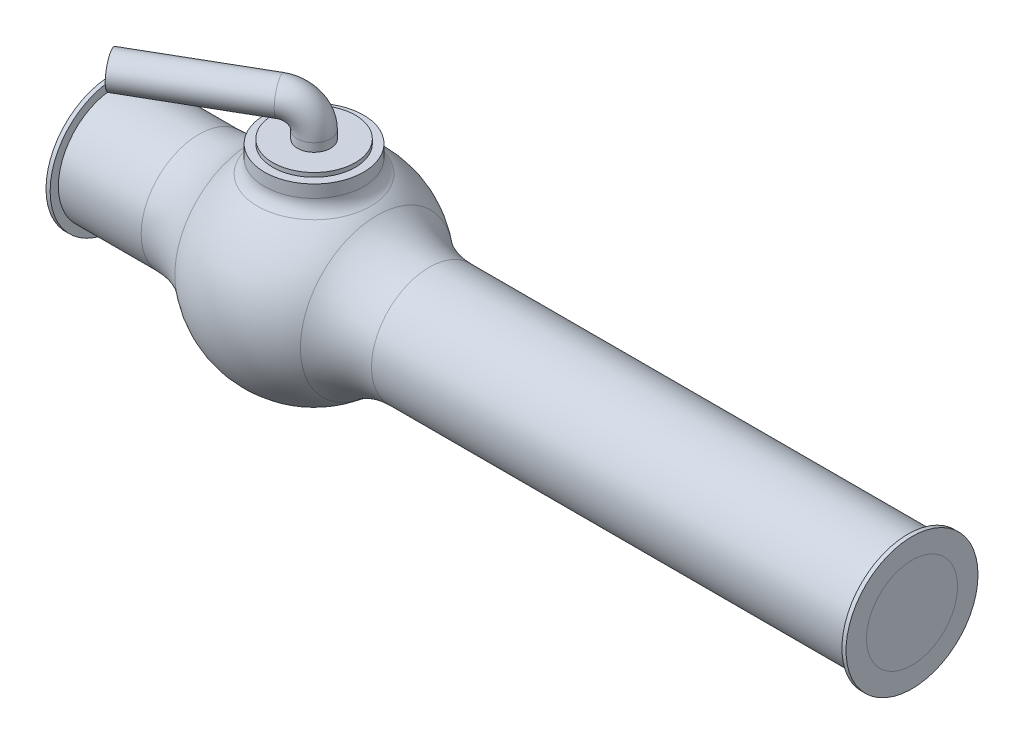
ISO-10303-21;
HEADER;
FILE_DESCRIPTION(('STEP AP214'),'2;1');
FILE_NAME('part.step','',(''),(''),'','','');
FILE_SCHEMA(('AUTOMOTIVE_DESIGN { 1 0 10303 214 1 1 1 1 }'));
ENDSEC;
DATA;
#1=APPLICATION_CONTEXT('core data for automotive mechanical design processes');
#2=APPLICATION_PROTOCOL_DEFINITION('international standard','automotive_design',2000,#1);
#3=PRODUCT_CONTEXT('',#1,'mechanical');
#4=PRODUCT('Part','Part','',(#3));
#5=PRODUCT_RELATED_PRODUCT_CATEGORY('part','',(#4));
#6=PRODUCT_DEFINITION_FORMATION('','',#4);
#7=PRODUCT_DEFINITION_CONTEXT('part definition',#1,'design');
#8=PRODUCT_DEFINITION('design','',#6,#7);
#9=PRODUCT_DEFINITION_SHAPE('','',#8);
#10=(LENGTH_UNIT() NAMED_UNIT(*) SI_UNIT(.MILLI.,.METRE.));
#11=(NAMED_UNIT(*) PLANE_ANGLE_UNIT() SI_UNIT($,.RADIAN.));
#12=(NAMED_UNIT(*) SI_UNIT($,.STERADIAN.) SOLID_ANGLE_UNIT());
#13=UNCERTAINTY_MEASURE_WITH_UNIT(LENGTH_MEASURE(1.E-05),#10,'distance_accuracy_value','');
#14=(GEOMETRIC_REPRESENTATION_CONTEXT(3) GLOBAL_UNCERTAINTY_ASSIGNED_CONTEXT((#13)) GLOBAL_UNIT_ASSIGNED_CONTEXT((#10,
#11,#12)) REPRESENTATION_CONTEXT('',''));
#15=CARTESIAN_POINT('',(0.,0.,0.));
#16=DIRECTION('',(0.,0.,1.));
#17=DIRECTION('',(1.,0.,0.));
#18=AXIS2_PLACEMENT_3D('',#15,#16,#17);
#19=CARTESIAN_POINT('',(0.,0.,0.));
#20=DIRECTION('',(0.,1.,0.));
#21=DIRECTION('',(0.,0.,-1.));
#22=AXIS2_PLACEMENT_3D('',#19,#20,#21);
#23=SPHERICAL_SURFACE('',#22,120.);
#24=CARTESIAN_POINT('',(0.,98.4782167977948,0.));
#25=DIRECTION('',(0.,-1.,0.));
#26=DIRECTION('',(0.,0.,-1.));
#27=AXIS2_PLACEMENT_3D('',#24,#25,#26);
#28=CIRCLE('',#27,68.5714285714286);
#29=CARTESIAN_POINT('',(0.,98.4782167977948,-68.5714285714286));
#30=VERTEX_POINT('',#29);
#31=EDGE_CURVE('P0_E11',#30,#30,#28,.T.);
#32=ORIENTED_EDGE('',*,*,#31,.T.);
#33=EDGE_LOOP('',(#32));
#34=FACE_BOUND('',#33,.T.);
#35=CARTESIAN_POINT('',(76.1685820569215,0.,0.));
#36=DIRECTION('',(-1.,0.,0.));
#37=DIRECTION('',(0.,0.,1.));
#38=AXIS2_PLACEMENT_3D('',#35,#36,#37);
#39=CIRCLE('',#38,92.7272727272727);
#40=CARTESIAN_POINT('',(76.1685820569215,0.,92.7272727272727));
#41=VERTEX_POINT('',#40);
#42=EDGE_CURVE('P0_E90',#41,#41,#39,.T.);
#43=ORIENTED_EDGE('',*,*,#42,.T.);
#44=EDGE_LOOP('',(#43));
#45=FACE_BOUND('',#44,.T.);
#46=CARTESIAN_POINT('',(-76.1685820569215,0.,0.));
#47=DIRECTION('',(1.,0.,0.));
#48=DIRECTION('',(0.,0.,-1.));
#49=AXIS2_PLACEMENT_3D('',#46,#47,#48);
#50=CIRCLE('',#49,92.7272727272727);
#51=CARTESIAN_POINT('',(-76.1685820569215,0.,-92.7272727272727));
#52=VERTEX_POINT('',#51);
#53=EDGE_CURVE('P0_E83',#52,#52,#50,.T.);
#54=ORIENTED_EDGE('',*,*,#53,.T.);
#55=EDGE_LOOP('',(#54));
#56=FACE_BOUND('',#55,.T.);
#57=ADVANCED_FACE('P0_F34',(#34,#45,#56),#23,.T.);
#58=CARTESIAN_POINT('',(0.,0.,0.));
#59=DIRECTION('',(0.,1.,0.));
#60=DIRECTION('',(0.,0.,-1.));
#61=AXIS2_PLACEMENT_3D('',#58,#59,#60);
#62=SPHERICAL_SURFACE('',#61,100.);
#63=CARTESIAN_POINT('',(-83.3885822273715,0.,0.));
#64=DIRECTION('',(1.,0.,0.));
#65=DIRECTION('',(0.,0.,-1.));
#66=AXIS2_PLACEMENT_3D('',#63,#64,#65);
#67=CIRCLE('',#66,55.1936985);
#68=CARTESIAN_POINT('',(-83.3885822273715,-50.4687461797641,22.3439032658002));
#69=VERTEX_POINT('',#68);
#70=CARTESIAN_POINT('',(-83.3885822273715,50.4687461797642,22.3439032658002));
#71=VERTEX_POINT('',#70);
#72=EDGE_CURVE('P0_E48',#69,#71,#67,.F.);
#73=ORIENTED_EDGE('',*,*,#72,.T.);
#74=CARTESIAN_POINT('',(-72.2166305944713,0.,41.6942911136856));
#75=DIRECTION('',(0.86602540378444,0.,-0.499999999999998));
#76=DIRECTION('',(-0.499999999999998,0.,-0.86602540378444));
#77=AXIS2_PLACEMENT_3D('',#74,#75,#76);
#78=CIRCLE('',#77,55.1936985);
#79=EDGE_CURVE('P0_E70',#71,#69,#78,.T.);
#80=ORIENTED_EDGE('',*,*,#79,.T.);
#81=EDGE_LOOP('',(#73,#80));
#82=FACE_BOUND('',#81,.T.);
#83=ADVANCED_FACE('P0_F78',(#82),#62,.F.);
#84=CARTESIAN_POINT('',(0.,135.,0.));
#85=DIRECTION('',(0.,1.,0.));
#86=DIRECTION('',(0.,0.,1.));
#87=AXIS2_PLACEMENT_3D('',#84,#85,#86);
#88=PLANE('',#87);
#89=CARTESIAN_POINT('',(0.,135.,0.));
#90=DIRECTION('',(0.,1.,0.));
#91=DIRECTION('',(0.,0.,1.));
#92=AXIS2_PLACEMENT_3D('',#89,#90,#91);
#93=CIRCLE('',#92,50.);
#94=CARTESIAN_POINT('',(0.,135.,50.));
#95=VERTEX_POINT('',#94);
#96=EDGE_CURVE('P0_E197',#95,#95,#93,.T.);
#97=ORIENTED_EDGE('',*,*,#96,.T.);
#98=EDGE_LOOP('',(#97));
#99=FACE_BOUND('',#98,.T.);
#100=CARTESIAN_POINT('',(0.,135.,0.));
#101=DIRECTION('',(0.,1.,0.));
#102=DIRECTION('',(0.,0.,1.));
#103=AXIS2_PLACEMENT_3D('',#100,#101,#102);
#104=CIRCLE('',#103,20.);
#105=CARTESIAN_POINT('',(0.,135.,20.));
#106=VERTEX_POINT('',#105);
#107=EDGE_CURVE('P0_E186',#106,#106,#104,.T.);
#108=ORIENTED_EDGE('',*,*,#107,.F.);
#109=EDGE_LOOP('',(#108));
#110=FACE_BOUND('',#109,.T.);
#111=ADVANCED_FACE('P0_F116',(#99,#110),#88,.T.);
#112=CARTESIAN_POINT('',(0.,135.,0.));
#113=DIRECTION('',(0.,-1.,0.));
#114=DIRECTION('',(0.,0.,-1.));
#115=AXIS2_PLACEMENT_3D('',#112,#113,#114);
#116=CYLINDRICAL_SURFACE('',#115,50.);
#117=ORIENTED_EDGE('',*,*,#96,.F.);
#118=EDGE_LOOP('',(#117));
#119=FACE_BOUND('',#118,.T.);
#120=CARTESIAN_POINT('',(0.,130.,0.));
#121=DIRECTION('',(0.,1.,0.));
#122=DIRECTION('',(0.,0.,1.));
#123=AXIS2_PLACEMENT_3D('',#120,#121,#122);
#124=CIRCLE('',#123,50.);
#125=CARTESIAN_POINT('',(0.,130.,50.));
#126=VERTEX_POINT('',#125);
#127=EDGE_CURVE('P0_E183',#126,#126,#124,.T.);
#128=ORIENTED_EDGE('',*,*,#127,.T.);
#129=EDGE_LOOP('',(#128));
#130=FACE_BOUND('',#129,.T.);
#131=ADVANCED_FACE('P0_F144',(#119,#130),#116,.T.);
#132=CARTESIAN_POINT('',(-25.9807621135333,175.,14.9999999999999));
#133=DIRECTION('',(-0.866025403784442,0.,0.499999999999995));
#134=DIRECTION('',(0.499999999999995,0.,0.866025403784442));
#135=AXIS2_PLACEMENT_3D('',#132,#133,#134);
#136=CYLINDRICAL_SURFACE('',#135,20.);
#137=CARTESIAN_POINT('',(-25.9807621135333,175.,14.9999999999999));
#138=DIRECTION('',(-0.866025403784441,0.,0.499999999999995));
#139=DIRECTION('',(0.433012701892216,-0.499999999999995,0.750000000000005));
#140=AXIS2_PLACEMENT_3D('',#137,#138,#139);
#141=CIRCLE('',#140,20.);
#142=CARTESIAN_POINT('',(-25.9807621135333,195.,14.9999999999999));
#143=VERTEX_POINT('',#142);
#144=EDGE_CURVE('P0_E190',#143,#143,#141,.T.);
#145=ORIENTED_EDGE('',*,*,#144,.T.);
#146=EDGE_LOOP('',(#145));
#147=FACE_BOUND('',#146,.T.);
#148=CARTESIAN_POINT('',(-155.8845726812,175.,89.9999999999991));
#149=DIRECTION('',(-0.866025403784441,0.,0.499999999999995));
#150=DIRECTION('',(0.433012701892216,-0.499999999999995,0.750000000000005));
#151=AXIS2_PLACEMENT_3D('',#148,#149,#150);
#152=CIRCLE('',#151,20.);
#153=CARTESIAN_POINT('',(-147.224318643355,165.,104.999999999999));
#154=VERTEX_POINT('',#153);
#155=EDGE_CURVE('P0_E195',#154,#154,#152,.T.);
#156=ORIENTED_EDGE('',*,*,#155,.F.);
#157=EDGE_LOOP('',(#156));
#158=FACE_BOUND('',#157,.T.);
#159=ADVANCED_FACE('P0_F140',(#147,#158),#136,.T.);
#160=CARTESIAN_POINT('',(-25.9807621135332,145.,14.9999999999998));
#161=DIRECTION('',(0.499999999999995,0.,0.866025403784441));
#162=DIRECTION('',(0.866025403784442,0.,-0.499999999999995));
#163=AXIS2_PLACEMENT_3D('',#160,#161,#162);
#164=TOROIDAL_SURFACE('',#163,30.,20.);
#165=CARTESIAN_POINT('',(0.,145.,0.));
#166=DIRECTION('',(0.,1.,0.));
#167=DIRECTION('',(0.,0.,1.));
#168=AXIS2_PLACEMENT_3D('',#165,#166,#167);
#169=CIRCLE('',#168,20.);
#170=CARTESIAN_POINT('',(17.3205080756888,145.,-9.9999999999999));
#171=VERTEX_POINT('',#170);
#172=EDGE_CURVE('P0_E187',#171,#171,#169,.T.);
#173=CARTESIAN_POINT('',(-25.9807621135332,145.,14.9999999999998));
#174=DIRECTION('',(0.499999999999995,0.,0.866025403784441));
#175=DIRECTION('',(0.866025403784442,0.,-0.499999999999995));
#176=AXIS2_PLACEMENT_3D('',#173,#174,#175);
#177=CIRCLE('',#176,50.);
#178=EDGE_CURVE('',#171,#143,#177,.T.);
#179=ORIENTED_EDGE('',*,*,#172,.T.);
#180=ORIENTED_EDGE('',*,*,#144,.F.);
#181=ORIENTED_EDGE('',*,*,#178,.T.);
#182=ORIENTED_EDGE('',*,*,#178,.F.);
#183=EDGE_LOOP('',(#179,#181,#180,#182));
#184=FACE_BOUND('',#183,.T.);
#185=ADVANCED_FACE('P0_F136',(#184),#164,.T.);
#186=CARTESIAN_POINT('',(0.,145.,0.));
#187=DIRECTION('',(0.,-1.,0.));
#188=DIRECTION('',(0.,0.,-1.));
#189=AXIS2_PLACEMENT_3D('',#186,#187,#188);
#190=CYLINDRICAL_SURFACE('',#189,20.);
#191=ORIENTED_EDGE('',*,*,#172,.F.);
#192=EDGE_LOOP('',(#191));
#193=FACE_BOUND('',#192,.T.);
#194=ORIENTED_EDGE('',*,*,#107,.T.);
#195=EDGE_LOOP('',(#194));
#196=FACE_BOUND('',#195,.T.);
#197=ADVANCED_FACE('P0_F132',(#193,#196),#190,.T.);
#198=CARTESIAN_POINT('',(-155.8845726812,175.,89.9999999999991));
#199=DIRECTION('',(-0.866025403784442,0.,0.499999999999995));
#200=DIRECTION('',(0.433012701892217,-0.499999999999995,0.750000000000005));
#201=AXIS2_PLACEMENT_3D('',#198,#199,#200);
#202=PLANE('',#201);
#203=ORIENTED_EDGE('',*,*,#155,.T.);
#204=EDGE_LOOP('',(#203));
#205=FACE_BOUND('',#204,.T.);
#206=ADVANCED_FACE('P0_F125',(#205),#202,.T.);
#207=CARTESIAN_POINT('',(0.,180.,0.));
#208=DIRECTION('',(0.,1.,0.));
#209=DIRECTION('',(0.,0.,1.));
#210=AXIS2_PLACEMENT_3D('',#207,#208,#209);
#211=CYLINDRICAL_SURFACE('',#210,60.);
#212=CARTESIAN_POINT('',(0.,114.891252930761,0.));
#213=DIRECTION('',(0.,-1.,0.));
#214=DIRECTION('',(0.,0.,-1.));
#215=AXIS2_PLACEMENT_3D('',#212,#213,#214);
#216=CIRCLE('',#215,60.);
#217=CARTESIAN_POINT('',(0.,114.891252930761,-60.));
#218=VERTEX_POINT('',#217);
#219=EDGE_CURVE('P0_E42',#218,#218,#216,.F.);
#220=ORIENTED_EDGE('',*,*,#219,.T.);
#221=EDGE_LOOP('',(#220));
#222=FACE_BOUND('',#221,.T.);
#223=CARTESIAN_POINT('',(0.,130.,0.));
#224=DIRECTION('',(0.,1.,0.));
#225=DIRECTION('',(0.,0.,1.));
#226=AXIS2_PLACEMENT_3D('',#223,#224,#225);
#227=CIRCLE('',#226,60.);
#228=CARTESIAN_POINT('',(0.,130.,60.));
#229=VERTEX_POINT('',#228);
#230=EDGE_CURVE('P0_E180',#229,#229,#227,.T.);
#231=ORIENTED_EDGE('',*,*,#230,.F.);
#232=EDGE_LOOP('',(#231));
#233=FACE_BOUND('',#232,.T.);
#234=ADVANCED_FACE('P0_F98',(#222,#233),#211,.T.);
#235=CARTESIAN_POINT('',(0.,130.,-40.));
#236=DIRECTION('',(0.,1.,0.));
#237=DIRECTION('',(0.,0.,1.));
#238=AXIS2_PLACEMENT_3D('',#235,#236,#237);
#239=PLANE('',#238);
#240=ORIENTED_EDGE('',*,*,#230,.T.);
#241=EDGE_LOOP('',(#240));
#242=FACE_BOUND('',#241,.T.);
#243=ORIENTED_EDGE('',*,*,#127,.F.);
#244=EDGE_LOOP('',(#243));
#245=FACE_BOUND('',#244,.T.);
#246=ADVANCED_FACE('P0_F124',(#242,#245),#239,.T.);
#247=CARTESIAN_POINT('',(-165.885572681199,0.,0.));
#248=DIRECTION('',(1.,0.,0.));
#249=DIRECTION('',(0.,0.,-1.));
#250=AXIS2_PLACEMENT_3D('',#247,#248,#249);
#251=CYLINDRICAL_SURFACE('',#250,70.);
#252=CARTESIAN_POINT('',(139.642400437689,0.,0.));
#253=DIRECTION('',(-1.,0.,0.));
#254=DIRECTION('',(0.,0.,1.));
#255=AXIS2_PLACEMENT_3D('',#252,#253,#254);
#256=CIRCLE('',#255,70.);
#257=CARTESIAN_POINT('',(139.642400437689,0.,70.));
#258=VERTEX_POINT('',#257);
#259=EDGE_CURVE('P0_E81',#258,#258,#256,.F.);
#260=ORIENTED_EDGE('',*,*,#259,.T.);
#261=EDGE_LOOP('',(#260));
#262=FACE_BOUND('',#261,.T.);
#263=CARTESIAN_POINT('',(720.,0.,0.));
#264=DIRECTION('',(1.,0.,0.));
#265=DIRECTION('',(0.,0.,-1.));
#266=AXIS2_PLACEMENT_3D('',#263,#264,#265);
#267=CIRCLE('',#266,70.);
#268=CARTESIAN_POINT('',(720.,0.,-70.));
#269=VERTEX_POINT('',#268);
#270=EDGE_CURVE('P0_E79',#269,#269,#267,.T.);
#271=ORIENTED_EDGE('',*,*,#270,.F.);
#272=EDGE_LOOP('',(#271));
#273=FACE_BOUND('',#272,.T.);
#274=ADVANCED_FACE('P0_F128',(#262,#273),#251,.T.);
#275=CARTESIAN_POINT('',(118.301270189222,0.,-68.3012701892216));
#276=DIRECTION('',(-0.86602540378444,0.,0.499999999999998));
#277=DIRECTION('',(0.499999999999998,0.,0.86602540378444));
#278=AXIS2_PLACEMENT_3D('',#275,#276,#277);
#279=CYLINDRICAL_SURFACE('',#278,55.1936985);
#280=CARTESIAN_POINT('',(72.2166305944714,0.,-41.6942911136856));
#281=DIRECTION('',(-0.86602540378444,0.,0.499999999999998));
#282=DIRECTION('',(0.499999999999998,0.,0.86602540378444));
#283=AXIS2_PLACEMENT_3D('',#280,#281,#282);
#284=CIRCLE('',#283,55.1936985);
#285=CARTESIAN_POINT('',(83.3885822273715,50.4687461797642,-22.3439032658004));
#286=VERTEX_POINT('',#285);
#287=CARTESIAN_POINT('',(83.3885822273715,-50.4687461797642,-22.3439032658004));
#288=VERTEX_POINT('',#287);
#289=EDGE_CURVE('P0_E71',#286,#288,#284,.T.);
#290=ORIENTED_EDGE('',*,*,#289,.F.);
#291=EDGE_CURVE('P0_E199',#288,#286,#284,.T.);
#292=ORIENTED_EDGE('',*,*,#291,.F.);
#293=EDGE_LOOP('',(#290,#292));
#294=FACE_BOUND('',#293,.T.);
#295=ORIENTED_EDGE('',*,*,#79,.F.);
#296=EDGE_CURVE('P0_E64',#69,#71,#78,.T.);
#297=ORIENTED_EDGE('',*,*,#296,.F.);
#298=EDGE_LOOP('',(#295,#297));
#299=FACE_BOUND('',#298,.T.);
#300=ADVANCED_FACE('P0_F80',(#294,#299),#279,.F.);
#301=CARTESIAN_POINT('',(0.,0.,0.));
#302=DIRECTION('',(0.,1.,0.));
#303=DIRECTION('',(0.,0.,-1.));
#304=AXIS2_PLACEMENT_3D('',#301,#302,#303);
#305=SPHERICAL_SURFACE('',#304,100.);
#306=ORIENTED_EDGE('',*,*,#291,.T.);
#307=CARTESIAN_POINT('',(83.3885822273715,0.,0.));
#308=DIRECTION('',(-1.,0.,0.));
#309=DIRECTION('',(0.,0.,1.));
#310=AXIS2_PLACEMENT_3D('',#307,#308,#309);
#311=CIRCLE('',#310,55.1936985);
#312=EDGE_CURVE('P0_E175',#288,#286,#311,.T.);
#313=ORIENTED_EDGE('',*,*,#312,.F.);
#314=EDGE_LOOP('',(#306,#313));
#315=FACE_BOUND('',#314,.T.);
#316=ADVANCED_FACE('P0_F154',(#315),#305,.T.);
#317=ORIENTED_EDGE('',*,*,#289,.T.);
#318=EDGE_CURVE('P0_E55',#286,#288,#311,.T.);
#319=ORIENTED_EDGE('',*,*,#318,.F.);
#320=EDGE_LOOP('',(#317,#319));
#321=FACE_BOUND('',#320,.T.);
#322=ADVANCED_FACE('P0_F118',(#321),#62,.F.);
#323=CARTESIAN_POINT('',(-165.885572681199,0.,0.));
#324=DIRECTION('',(1.,0.,0.));
#325=DIRECTION('',(0.,0.,-1.));
#326=AXIS2_PLACEMENT_3D('',#323,#324,#325);
#327=CYLINDRICAL_SURFACE('',#326,55.1936985);
#328=ORIENTED_EDGE('',*,*,#318,.T.);
#329=ORIENTED_EDGE('',*,*,#312,.T.);
#330=EDGE_LOOP('',(#328,#329));
#331=FACE_BOUND('',#330,.T.);
#332=CARTESIAN_POINT('',(725.,0.,0.));
#333=DIRECTION('',(1.,0.,0.));
#334=DIRECTION('',(0.,0.,-1.));
#335=AXIS2_PLACEMENT_3D('',#332,#333,#334);
#336=CIRCLE('',#335,55.1936985);
#337=CARTESIAN_POINT('',(725.,0.,-55.1936985));
#338=VERTEX_POINT('',#337);
#339=EDGE_CURVE('P0_E259',#338,#338,#336,.T.);
#340=ORIENTED_EDGE('',*,*,#339,.T.);
#341=EDGE_LOOP('',(#340));
#342=FACE_BOUND('',#341,.T.);
#343=ADVANCED_FACE('P0_F207',(#331,#342),#327,.F.);
#344=CARTESIAN_POINT('',(0.,0.,0.));
#345=DIRECTION('',(0.,1.,0.));
#346=DIRECTION('',(0.,0.,-1.));
#347=AXIS2_PLACEMENT_3D('',#344,#345,#346);
#348=SPHERICAL_SURFACE('',#347,100.);
#349=ORIENTED_EDGE('',*,*,#296,.T.);
#350=EDGE_CURVE('P0_E66',#71,#69,#67,.F.);
#351=ORIENTED_EDGE('',*,*,#350,.T.);
#352=EDGE_LOOP('',(#349,#351));
#353=FACE_BOUND('',#352,.T.);
#354=ADVANCED_FACE('P0_F65',(#353),#348,.T.);
#355=CARTESIAN_POINT('',(720.001,0.,0.));
#356=DIRECTION('',(-1.,0.,0.));
#357=DIRECTION('',(0.,0.,1.));
#358=AXIS2_PLACEMENT_3D('',#355,#356,#357);
#359=CYLINDRICAL_SURFACE('',#358,55.1936985);
#360=ORIENTED_EDGE('',*,*,#72,.F.);
#361=ORIENTED_EDGE('',*,*,#350,.F.);
#362=EDGE_LOOP('',(#360,#361));
#363=FACE_BOUND('',#362,.T.);
#364=CARTESIAN_POINT('',(-245.,0.,0.));
#365=DIRECTION('',(-1.,0.,0.));
#366=DIRECTION('',(0.,0.,1.));
#367=AXIS2_PLACEMENT_3D('',#364,#365,#366);
#368=CIRCLE('',#367,55.1936985);
#369=CARTESIAN_POINT('',(-245.,0.,55.1936985));
#370=VERTEX_POINT('',#369);
#371=EDGE_CURVE('P0_E249',#370,#370,#368,.T.);
#372=ORIENTED_EDGE('',*,*,#371,.T.);
#373=EDGE_LOOP('',(#372));
#374=FACE_BOUND('',#373,.T.);
#375=ADVANCED_FACE('P0_F73',(#363,#374),#359,.F.);
#376=CARTESIAN_POINT('',(720.001,0.,0.));
#377=DIRECTION('',(-1.,0.,0.));
#378=DIRECTION('',(0.,0.,1.));
#379=AXIS2_PLACEMENT_3D('',#376,#377,#378);
#380=CYLINDRICAL_SURFACE('',#379,70.);
#381=CARTESIAN_POINT('',(-139.642400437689,0.,0.));
#382=DIRECTION('',(1.,0.,0.));
#383=DIRECTION('',(0.,0.,-1.));
#384=AXIS2_PLACEMENT_3D('',#381,#382,#383);
#385=CIRCLE('',#384,70.);
#386=CARTESIAN_POINT('',(-139.642400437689,0.,-70.));
#387=VERTEX_POINT('',#386);
#388=EDGE_CURVE('P0_E93',#387,#387,#385,.F.);
#389=ORIENTED_EDGE('',*,*,#388,.T.);
#390=EDGE_LOOP('',(#389));
#391=FACE_BOUND('',#390,.T.);
#392=CARTESIAN_POINT('',(-240.,0.,0.));
#393=DIRECTION('',(-1.,0.,0.));
#394=DIRECTION('',(0.,0.,1.));
#395=AXIS2_PLACEMENT_3D('',#392,#393,#394);
#396=CIRCLE('',#395,70.);
#397=CARTESIAN_POINT('',(-240.,0.,70.));
#398=VERTEX_POINT('',#397);
#399=EDGE_CURVE('P0_E255',#398,#398,#396,.T.);
#400=ORIENTED_EDGE('',*,*,#399,.F.);
#401=EDGE_LOOP('',(#400));
#402=FACE_BOUND('',#401,.T.);
#403=ADVANCED_FACE('P0_F220',(#391,#402),#380,.T.);
#404=CARTESIAN_POINT('',(725.,0.,0.));
#405=DIRECTION('',(1.,0.,0.));
#406=DIRECTION('',(0.,0.,-1.));
#407=AXIS2_PLACEMENT_3D('',#404,#405,#406);
#408=PLANE('',#407);
#409=CARTESIAN_POINT('',(725.,0.,0.));
#410=DIRECTION('',(1.,0.,0.));
#411=DIRECTION('',(0.,0.,-1.));
#412=AXIS2_PLACEMENT_3D('',#409,#410,#411);
#413=CIRCLE('',#412,80.);
#414=CARTESIAN_POINT('',(725.,0.,-80.));
#415=VERTEX_POINT('',#414);
#416=EDGE_CURVE('P0_E75',#415,#415,#413,.T.);
#417=ORIENTED_EDGE('',*,*,#416,.T.);
#418=EDGE_LOOP('',(#417));
#419=FACE_BOUND('',#418,.T.);
#420=ORIENTED_EDGE('',*,*,#339,.F.);
#421=EDGE_LOOP('',(#420));
#422=FACE_BOUND('',#421,.T.);
#423=ADVANCED_FACE('P0_F223',(#419,#422),#408,.T.);
#424=CARTESIAN_POINT('',(720.,0.,0.));
#425=DIRECTION('',(1.,0.,0.));
#426=DIRECTION('',(0.,0.,-1.));
#427=AXIS2_PLACEMENT_3D('',#424,#425,#426);
#428=PLANE('',#427);
#429=ORIENTED_EDGE('',*,*,#270,.T.);
#430=EDGE_LOOP('',(#429));
#431=FACE_BOUND('',#430,.T.);
#432=CARTESIAN_POINT('',(720.,0.,0.));
#433=DIRECTION('',(1.,0.,0.));
#434=DIRECTION('',(0.,0.,-1.));
#435=AXIS2_PLACEMENT_3D('',#432,#433,#434);
#436=CIRCLE('',#435,80.);
#437=CARTESIAN_POINT('',(720.,0.,-80.));
#438=VERTEX_POINT('',#437);
#439=EDGE_CURVE('P0_E262',#438,#438,#436,.T.);
#440=ORIENTED_EDGE('',*,*,#439,.F.);
#441=EDGE_LOOP('',(#440));
#442=FACE_BOUND('',#441,.T.);
#443=ADVANCED_FACE('P0_F229',(#431,#442),#428,.F.);
#444=CARTESIAN_POINT('',(725.,0.,0.));
#445=DIRECTION('',(-1.,0.,0.));
#446=DIRECTION('',(0.,0.,1.));
#447=AXIS2_PLACEMENT_3D('',#444,#445,#446);
#448=CYLINDRICAL_SURFACE('',#447,80.);
#449=ORIENTED_EDGE('',*,*,#416,.F.);
#450=EDGE_LOOP('',(#449));
#451=FACE_BOUND('',#450,.T.);
#452=ORIENTED_EDGE('',*,*,#439,.T.);
#453=EDGE_LOOP('',(#452));
#454=FACE_BOUND('',#453,.T.);
#455=ADVANCED_FACE('P0_F225',(#451,#454),#448,.T.);
#456=CARTESIAN_POINT('',(-240.,0.,0.));
#457=DIRECTION('',(-1.,0.,0.));
#458=DIRECTION('',(0.,0.,1.));
#459=AXIS2_PLACEMENT_3D('',#456,#457,#458);
#460=PLANE('',#459);
#461=CARTESIAN_POINT('',(-240.,0.,0.));
#462=DIRECTION('',(-1.,0.,0.));
#463=DIRECTION('',(0.,0.,1.));
#464=AXIS2_PLACEMENT_3D('',#461,#462,#463);
#465=CIRCLE('',#464,80.);
#466=CARTESIAN_POINT('',(-240.,0.,80.));
#467=VERTEX_POINT('',#466);
#468=EDGE_CURVE('P0_E250',#467,#467,#465,.T.);
#469=ORIENTED_EDGE('',*,*,#468,.F.);
#470=EDGE_LOOP('',(#469));
#471=FACE_BOUND('',#470,.T.);
#472=ORIENTED_EDGE('',*,*,#399,.T.);
#473=EDGE_LOOP('',(#472));
#474=FACE_BOUND('',#473,.T.);
#475=ADVANCED_FACE('P0_F228',(#471,#474),#460,.F.);
#476=CARTESIAN_POINT('',(-245.,0.,0.));
#477=DIRECTION('',(-1.,0.,0.));
#478=DIRECTION('',(0.,0.,1.));
#479=AXIS2_PLACEMENT_3D('',#476,#477,#478);
#480=PLANE('',#479);
#481=CARTESIAN_POINT('',(-245.,0.,0.));
#482=DIRECTION('',(-1.,0.,0.));
#483=DIRECTION('',(0.,0.,1.));
#484=AXIS2_PLACEMENT_3D('',#481,#482,#483);
#485=CIRCLE('',#484,80.);
#486=CARTESIAN_POINT('',(-245.,0.,80.));
#487=VERTEX_POINT('',#486);
#488=EDGE_CURVE('P0_E246',#487,#487,#485,.T.);
#489=ORIENTED_EDGE('',*,*,#488,.T.);
#490=EDGE_LOOP('',(#489));
#491=FACE_BOUND('',#490,.T.);
#492=ORIENTED_EDGE('',*,*,#371,.F.);
#493=EDGE_LOOP('',(#492));
#494=FACE_BOUND('',#493,.T.);
#495=ADVANCED_FACE('P0_F162',(#491,#494),#480,.T.);
#496=CARTESIAN_POINT('',(-245.,0.,0.));
#497=DIRECTION('',(1.,0.,0.));
#498=DIRECTION('',(0.,0.,-1.));
#499=AXIS2_PLACEMENT_3D('',#496,#497,#498);
#500=CYLINDRICAL_SURFACE('',#499,80.);
#501=ORIENTED_EDGE('',*,*,#488,.F.);
#502=EDGE_LOOP('',(#501));
#503=FACE_BOUND('',#502,.T.);
#504=ORIENTED_EDGE('',*,*,#468,.T.);
#505=EDGE_LOOP('',(#504));
#506=FACE_BOUND('',#505,.T.);
#507=ADVANCED_FACE('P0_F157',(#503,#506),#500,.T.);
#508=CARTESIAN_POINT('',(139.642400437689,0.,0.));
#509=DIRECTION('',(-1.,0.,0.));
#510=DIRECTION('',(0.,0.,1.));
#511=AXIS2_PLACEMENT_3D('',#508,#509,#510);
#512=TOROIDAL_SURFACE('',#511,170.,100.);
#513=ORIENTED_EDGE('',*,*,#42,.F.);
#514=EDGE_LOOP('',(#513));
#515=FACE_BOUND('',#514,.T.);
#516=ORIENTED_EDGE('',*,*,#259,.F.);
#517=EDGE_LOOP('',(#516));
#518=FACE_BOUND('',#517,.T.);
#519=ADVANCED_FACE('P0_F107',(#515,#518),#512,.F.);
#520=CARTESIAN_POINT('',(-139.642400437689,0.,0.));
#521=DIRECTION('',(1.,0.,0.));
#522=DIRECTION('',(0.,0.,-1.));
#523=AXIS2_PLACEMENT_3D('',#520,#521,#522);
#524=TOROIDAL_SURFACE('',#523,170.,100.);
#525=ORIENTED_EDGE('',*,*,#53,.F.);
#526=EDGE_LOOP('',(#525));
#527=FACE_BOUND('',#526,.T.);
#528=ORIENTED_EDGE('',*,*,#388,.F.);
#529=EDGE_LOOP('',(#528));
#530=FACE_BOUND('',#529,.T.);
#531=ADVANCED_FACE('P0_F102',(#527,#530),#524,.F.);
#532=CARTESIAN_POINT('',(0.,114.891252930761,0.));
#533=DIRECTION('',(0.,-1.,0.));
#534=DIRECTION('',(0.,0.,-1.));
#535=AXIS2_PLACEMENT_3D('',#532,#533,#534);
#536=TOROIDAL_SURFACE('',#535,80.,20.);
#537=ORIENTED_EDGE('',*,*,#31,.F.);
#538=EDGE_LOOP('',(#537));
#539=FACE_BOUND('',#538,.T.);
#540=ORIENTED_EDGE('',*,*,#219,.F.);
#541=EDGE_LOOP('',(#540));
#542=FACE_BOUND('',#541,.T.);
#543=ADVANCED_FACE('P0_F36',(#539,#542),#536,.F.);
#544=CLOSED_SHELL('',(#57,#83,#111,#131,#159,#185,#197,#206,#234,#246,#274,#300,#316,#322,#343,
#354,#375,#403,#423,#443,#455,#475,#495,#507,#519,#531,#543));
#545=MANIFOLD_SOLID_BREP('P0_B2',#544);
#546=CARTESIAN_POINT('',(-239.747482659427,0.,56.7548120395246));
#547=CARTESIAN_POINT('',(-239.747482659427,-1.85738434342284,56.7547902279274));
#548=CARTESIAN_POINT('',(-239.747482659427,-5.57205588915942,56.5735678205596));
#549=CARTESIAN_POINT('',(-239.747482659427,-11.0899439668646,55.7531503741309));
#550=CARTESIAN_POINT('',(-239.747482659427,-16.5018319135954,54.3995668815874));
#551=CARTESIAN_POINT('',(-239.747482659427,-21.7536265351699,52.5183705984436));
#552=CARTESIAN_POINT('',(-239.747482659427,-26.7975888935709,50.1349505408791));
#553=CARTESIAN_POINT('',(-239.747482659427,-31.5814658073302,47.265319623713));
#554=CARTESIAN_POINT('',(-239.747482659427,-36.0635220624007,43.9436685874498));
#555=CARTESIAN_POINT('',(-239.747482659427,-40.1956431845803,40.1958914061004));
#556=CARTESIAN_POINT('',(-239.747482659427,-43.9435589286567,36.0636615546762));
#557=CARTESIAN_POINT('',(-239.747482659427,-47.2651245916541,31.5817576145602));
#558=CARTESIAN_POINT('',(-239.747482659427,-50.1348638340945,26.7977435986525));
#559=CARTESIAN_POINT('',(-239.747482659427,-52.5182337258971,21.7539546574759));
#560=CARTESIAN_POINT('',(-239.747482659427,-54.3995204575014,16.5020068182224));
#561=CARTESIAN_POINT('',(-239.747482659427,-55.7530966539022,11.0901593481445));
#562=CARTESIAN_POINT('',(-239.747482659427,-56.5736269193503,5.57210506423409));
#563=CARTESIAN_POINT('',(-239.747482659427,-56.8453995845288,0.000179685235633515));
#564=CARTESIAN_POINT('',(-239.747482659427,-56.573646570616,-5.57192449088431));
#565=CARTESIAN_POINT('',(-239.747482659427,-55.7531667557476,-11.0898069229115));
#566=CARTESIAN_POINT('',(-239.747482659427,-54.3995714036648,-16.5018324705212));
#567=CARTESIAN_POINT('',(-239.747482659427,-52.5183712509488,-21.7536226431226));
#568=CARTESIAN_POINT('',(-239.747482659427,-50.1349510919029,-26.7975842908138));
#569=CARTESIAN_POINT('',(-239.747482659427,-47.265324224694,-31.5814588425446));
#570=CARTESIAN_POINT('',(-239.747482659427,-43.9436727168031,-36.0635199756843));
#571=CARTESIAN_POINT('',(-239.747482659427,-40.1958972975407,-40.195637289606));
#572=CARTESIAN_POINT('',(-239.747482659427,-36.0636636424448,-43.9435548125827));
#573=CARTESIAN_POINT('',(-239.747482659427,-31.5817645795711,-47.2651199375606));
#574=CARTESIAN_POINT('',(-239.747482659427,-26.7977481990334,-50.1348634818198));
#575=CARTESIAN_POINT('',(-239.747482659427,-21.7539623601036,-52.5182305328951));
#576=CARTESIAN_POINT('',(-239.747482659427,-16.5020103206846,-54.3995174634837));
#577=CARTESIAN_POINT('',(-239.747482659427,-11.0901675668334,-55.753094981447));
#578=CARTESIAN_POINT('',(-239.747482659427,-5.57210944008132,-56.5736284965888));
#579=CARTESIAN_POINT('',(-239.747482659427,-0.00018385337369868,-56.8453992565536));
#580=CARTESIAN_POINT('',(-239.747482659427,5.57192448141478,-56.5736467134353));
#581=CARTESIAN_POINT('',(-239.747482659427,11.0898069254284,-55.7531667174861));
#582=CARTESIAN_POINT('',(-239.747482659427,16.5018324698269,-54.3995714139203));
#583=CARTESIAN_POINT('',(-239.747482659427,21.7536226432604,-52.5183712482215));
#584=CARTESIAN_POINT('',(-239.747482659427,26.7975842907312,-50.1349510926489));
#585=CARTESIAN_POINT('',(-239.747482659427,31.5814588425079,-47.265324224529));
#586=CARTESIAN_POINT('',(-239.747482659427,36.0635199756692,-43.9436727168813));
#587=CARTESIAN_POINT('',(-239.747482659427,40.1956372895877,-40.1958972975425));
#588=CARTESIAN_POINT('',(-239.747482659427,43.9435548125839,-36.0636636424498));
#589=CARTESIAN_POINT('',(-239.747482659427,47.2651199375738,-31.5817645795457));
#590=CARTESIAN_POINT('',(-239.747482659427,50.1348634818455,-26.7977481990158));
#591=CARTESIAN_POINT('',(-239.747482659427,52.5182305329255,-21.7539623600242));
#592=CARTESIAN_POINT('',(-239.747482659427,54.3995174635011,-16.5020103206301));
#593=CARTESIAN_POINT('',(-239.747482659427,55.753094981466,-11.0901675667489));
#594=CARTESIAN_POINT('',(-239.747482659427,56.5736284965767,-5.57210944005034));
#595=CARTESIAN_POINT('',(-239.747482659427,56.8453992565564,-0.000183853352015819));
#596=CARTESIAN_POINT('',(-239.747482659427,56.5736467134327,5.57192448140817));
#597=CARTESIAN_POINT('',(-239.747482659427,55.7531667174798,11.0898069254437));
#598=CARTESIAN_POINT('',(-239.747482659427,54.3995714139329,16.5018324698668));
#599=CARTESIAN_POINT('',(-239.747482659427,52.5183712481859,21.7536226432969));
#600=CARTESIAN_POINT('',(-239.747482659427,50.1349510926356,26.7975842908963));
#601=CARTESIAN_POINT('',(-239.747482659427,47.2653242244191,31.5814588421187));
#602=CARTESIAN_POINT('',(-239.747482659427,43.9436727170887,36.063519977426));
#603=CARTESIAN_POINT('',(-239.747482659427,40.1958972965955,40.1956372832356));
#604=CARTESIAN_POINT('',(-239.747482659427,36.0636636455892,43.9435548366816));
#605=CARTESIAN_POINT('',(-239.747482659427,31.5817645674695,47.2651198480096));
#606=CARTESIAN_POINT('',(-239.747482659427,26.7977482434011,50.1348638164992));
#607=CARTESIAN_POINT('',(-239.747482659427,21.7539621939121,52.5182292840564));
#608=CARTESIAN_POINT('',(-239.747482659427,16.50201094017,54.3995221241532));
#609=CARTESIAN_POINT('',(-239.747482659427,11.090030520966,55.7531112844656));
#610=CARTESIAN_POINT('',(-239.747482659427,5.57197805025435,56.5737074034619));
#611=CARTESIAN_POINT('',(-239.747482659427,1.85729364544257,56.7548338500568));
#612=CARTESIAN_POINT('',(-239.747482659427,0.,56.7548120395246));
#613=B_SPLINE_CURVE_WITH_KNOTS('',3,(#546,#547,#548,#549,#550,#551,#552,#553,#554,#555,#556,
#557,#558,#559,#560,#561,#562,#563,#564,#565,#566,#567,#568,#569,#570,#571,#572,#573,#574,#575,
#576,#577,#578,#579,#580,#581,#582,#583,#584,#585,#586,#587,#588,#589,#590,#591,#592,#593,#594,
#595,#596,#597,#598,#599,#600,#601,#602,#603,#604,#605,#606,#607,#608,#609,#610,#611,#612),
.UNSPECIFIED.,.T.,.F.,(4,1,1,1,1,1,1,1,1,1,1,1,1,1,1,1,1,1,1,1,1,1,1,1,1,1,1,1,1,1,1,1,1,1,1,1,
1,1,1,1,1,1,1,1,1,1,1,1,1,1,1,1,1,1,1,1,1,1,1,1,1,1,1,1,4),(0.,0.0156253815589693,
0.0312499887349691,0.0468742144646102,0.0624999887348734,0.0781242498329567,0.0937499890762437,
0.109374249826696,0.124999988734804,0.140624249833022,0.156249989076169,0.171874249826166,
0.187499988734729,0.203124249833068,0.2187499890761,0.234374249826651,0.249999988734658,
0.265624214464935,0.281249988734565,0.296874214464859,0.312499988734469,0.328124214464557,
0.343749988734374,0.359374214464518,0.37499998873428,0.390624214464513,0.406249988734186,
0.421874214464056,0.437499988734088,0.453124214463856,0.468749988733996,0.48437421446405,
0.499999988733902,0.515624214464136,0.531249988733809,0.546874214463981,0.562499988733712,
0.578124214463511,0.593749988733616,0.609374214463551,0.624999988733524,0.640624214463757,
0.65624998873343,0.671874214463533,0.687499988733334,0.703124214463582,0.718749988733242,
0.734374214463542,0.749999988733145,0.765624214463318,0.781249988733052,0.796874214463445,
0.812499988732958,0.828124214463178,0.843749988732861,0.859374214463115,0.87499998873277,
0.890624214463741,0.906249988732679,0.921874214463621,0.93749998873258,0.953124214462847,
0.968749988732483,0.984375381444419,1.),.UNSPECIFIED.);
#614=DIRECTION('',(-1.,0.,0.));
#615=VECTOR('',#614,1.);
#616=SURFACE_OF_LINEAR_EXTRUSION('',#613,#615);
#617=CARTESIAN_POINT('',(-239.747482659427,8.09655093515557E-09,56.7548120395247));
#618=CARTESIAN_POINT('',(-239.747482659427,0.914365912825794,56.7548195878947));
#619=CARTESIAN_POINT('',(-239.747482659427,1.82875173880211,56.7328770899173));
#620=CARTESIAN_POINT('',(-239.747482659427,3.65537357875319,56.6448668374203));
#621=CARTESIAN_POINT('',(-239.747482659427,4.56760964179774,56.5788001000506));
#622=CARTESIAN_POINT('',(-239.747482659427,6.38778340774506,56.4023163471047));
#623=CARTESIAN_POINT('',(-239.747482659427,7.29572111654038,56.2918993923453));
#624=CARTESIAN_POINT('',(-239.747482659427,9.10521489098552,56.0273302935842));
#625=CARTESIAN_POINT('',(-239.747482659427,10.006770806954,55.8731771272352));
#626=CARTESIAN_POINT('',(-239.747482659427,11.8014479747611,55.5217848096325));
#627=CARTESIAN_POINT('',(-239.747482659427,12.6945692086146,55.3245455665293));
#628=CARTESIAN_POINT('',(-239.747482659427,14.470243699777,54.8872144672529));
#629=CARTESIAN_POINT('',(-239.747482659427,15.3527971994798,54.6471235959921));
#630=CARTESIAN_POINT('',(-239.747482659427,17.1051659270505,54.1242575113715));
#631=CARTESIAN_POINT('',(-239.747482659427,17.9749812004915,53.8414824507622));
#632=CARTESIAN_POINT('',(-239.747482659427,19.6999378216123,53.2342104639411));
#633=CARTESIAN_POINT('',(-239.747482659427,20.5550788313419,52.9097125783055));
#634=CARTESIAN_POINT('',(-239.747482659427,22.2488017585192,52.2200432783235));
#635=CARTESIAN_POINT('',(-239.747482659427,23.0873836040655,51.8548716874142));
#636=CARTESIAN_POINT('',(-239.747482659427,24.7459532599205,51.0845258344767));
#637=CARTESIAN_POINT('',(-239.747482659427,25.5659414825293,50.6793524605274));
#638=CARTESIAN_POINT('',(-239.747482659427,27.1852203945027,49.8295739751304));
#639=CARTESIAN_POINT('',(-239.747482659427,27.9845112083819,49.3849691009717));
#640=CARTESIAN_POINT('',(-239.747482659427,29.5606610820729,48.4576081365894));
#641=CARTESIAN_POINT('',(-239.747482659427,30.3375196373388,47.9748511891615));
#642=CARTESIAN_POINT('',(-239.747482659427,31.8671687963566,46.9725974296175));
#643=CARTESIAN_POINT('',(-239.747482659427,32.6199592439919,46.4531003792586));
#644=CARTESIAN_POINT('',(-239.747482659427,34.0996219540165,45.3784416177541));
#645=CARTESIAN_POINT('',(-239.747482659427,34.8264947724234,44.8232806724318));
#646=CARTESIAN_POINT('',(-239.747482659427,36.2523601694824,43.678248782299));
#647=CARTESIAN_POINT('',(-239.747482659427,36.9513529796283,43.0883781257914));
#648=CARTESIAN_POINT('',(-239.747482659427,38.3199741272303,41.875482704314));
#649=CARTESIAN_POINT('',(-239.747482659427,38.9896018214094,41.25245721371));
#650=CARTESIAN_POINT('',(-239.747482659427,40.2981737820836,39.974968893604));
#651=CARTESIAN_POINT('',(-239.747482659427,40.9371177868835,39.3205057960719));
#652=CARTESIAN_POINT('',(-239.747482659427,42.1827361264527,37.9815752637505));
#653=CARTESIAN_POINT('',(-239.747482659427,42.7894111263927,37.2971084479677));
#654=CARTESIAN_POINT('',(-239.747482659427,43.9687437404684,35.899479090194));
#655=CARTESIAN_POINT('',(-239.747482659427,44.5414017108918,35.1863168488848));
#656=CARTESIAN_POINT('',(-239.747482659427,45.651505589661,33.7330786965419));
#657=CARTESIAN_POINT('',(-239.747482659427,46.1889507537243,32.9930022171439));
#658=CARTESIAN_POINT('',(-239.747482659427,47.2276813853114,31.4878866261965));
#659=CARTESIAN_POINT('',(-239.747482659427,47.728966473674,30.7228472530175));
#660=CARTESIAN_POINT('',(-239.747482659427,48.694122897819,29.1695348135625));
#661=CARTESIAN_POINT('',(-239.747482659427,49.1579949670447,28.3812622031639));
#662=CARTESIAN_POINT('',(-239.747482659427,50.0468591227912,26.7831015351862));
#663=CARTESIAN_POINT('',(-239.747482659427,50.4718516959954,25.9732137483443));
#664=CARTESIAN_POINT('',(-239.747482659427,51.2820823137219,24.3337775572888));
#665=CARTESIAN_POINT('',(-239.747482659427,51.6673195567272,23.5042287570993));
#666=CARTESIAN_POINT('',(-239.747482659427,52.3975011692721,21.827575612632));
#667=CARTESIAN_POINT('',(-239.747482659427,52.742445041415,20.9804710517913));
#668=CARTESIAN_POINT('',(-239.747482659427,53.3911720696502,19.2706565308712));
#669=CARTESIAN_POINT('',(-239.747482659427,53.6949559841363,18.4079468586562));
#670=CARTESIAN_POINT('',(-239.747482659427,54.2602364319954,16.6687920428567));
#671=CARTESIAN_POINT('',(-239.747482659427,54.5217335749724,15.792347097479));
#672=CARTESIAN_POINT('',(-239.747482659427,55.0019077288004,14.0277931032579));
#673=CARTESIAN_POINT('',(-239.747482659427,55.2205839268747,13.1396838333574));
#674=CARTESIAN_POINT('',(-239.747482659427,55.6150076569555,11.35397473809));
#675=CARTESIAN_POINT('',(-239.747482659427,55.7907545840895,10.4563747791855));
#676=CARTESIAN_POINT('',(-239.747482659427,56.0988755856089,8.65377127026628));
#677=CARTESIAN_POINT('',(-239.747482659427,56.2312504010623,7.7487678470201));
#678=CARTESIAN_POINT('',(-239.747482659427,56.4518861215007,5.93340936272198));
#679=CARTESIAN_POINT('',(-239.747482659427,56.540147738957,5.02305438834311));
#680=CARTESIAN_POINT('',(-239.747482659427,56.6723790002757,3.19912272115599));
#681=CARTESIAN_POINT('',(-239.747482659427,56.7163478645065,2.28554597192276));
#682=CARTESIAN_POINT('',(-239.747482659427,56.760317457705,0.457325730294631));
#683=CARTESIAN_POINT('',(-239.747482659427,56.7603174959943,-0.457317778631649));
#684=CARTESIAN_POINT('',(-239.747482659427,56.7163480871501,-2.28553812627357));
#685=CARTESIAN_POINT('',(-239.747482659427,56.6723793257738,-3.19911498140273));
#686=CARTESIAN_POINT('',(-239.747482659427,56.5401483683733,-5.02304677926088));
#687=CARTESIAN_POINT('',(-239.747482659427,56.451886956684,-5.93340177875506));
#688=CARTESIAN_POINT('',(-239.747482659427,56.2312515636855,-7.74876020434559));
#689=CARTESIAN_POINT('',(-239.747482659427,56.0988768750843,-8.6537635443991));
#690=CARTESIAN_POINT('',(-239.747482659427,55.7907560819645,-10.4563669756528));
#691=CARTESIAN_POINT('',(-239.747482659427,55.6150092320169,-11.3539669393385));
#692=CARTESIAN_POINT('',(-239.747482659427,55.220585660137,-13.1396761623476));
#693=CARTESIAN_POINT('',(-239.747482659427,55.0019095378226,-14.0277855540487));
#694=CARTESIAN_POINT('',(-239.747482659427,54.5217356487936,-15.7923397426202));
#695=CARTESIAN_POINT('',(-239.747482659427,54.2602386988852,-16.6687847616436));
#696=CARTESIAN_POINT('',(-239.747482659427,53.6949585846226,-18.4079395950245));
#697=CARTESIAN_POINT('',(-239.747482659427,53.3911748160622,-19.2706492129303));
#698=CARTESIAN_POINT('',(-239.747482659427,52.7424480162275,-20.9804636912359));
#699=CARTESIAN_POINT('',(-239.747482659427,52.3975042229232,-21.8275682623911));
#700=CARTESIAN_POINT('',(-239.747482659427,51.6673227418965,-23.5042215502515));
#701=CARTESIAN_POINT('',(-239.747482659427,51.282085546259,-24.3337704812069));
#702=CARTESIAN_POINT('',(-239.747482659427,50.471855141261,-25.9732069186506));
#703=CARTESIAN_POINT('',(-239.747482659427,50.0468627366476,-26.7830948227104));
#704=CARTESIAN_POINT('',(-239.747482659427,49.1579989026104,-28.3812555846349));
#705=CARTESIAN_POINT('',(-239.747482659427,48.6941269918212,-29.1695281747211));
#706=CARTESIAN_POINT('',(-239.747482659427,47.7289708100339,-30.7228406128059));
#707=CARTESIAN_POINT('',(-239.747482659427,47.2276858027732,-31.487880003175));
#708=CARTESIAN_POINT('',(-239.747482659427,46.1889552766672,-32.99299574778));
#709=CARTESIAN_POINT('',(-239.747482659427,45.6515101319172,-33.7330723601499));
#710=CARTESIAN_POINT('',(-239.747482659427,44.5414064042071,-35.1863107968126));
#711=CARTESIAN_POINT('',(-239.747482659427,43.9687485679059,-35.8994731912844));
#712=CARTESIAN_POINT('',(-239.747482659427,42.7894162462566,-37.2971027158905));
#713=CARTESIAN_POINT('',(-239.747482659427,42.1827414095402,-37.9815695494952));
#714=CARTESIAN_POINT('',(-239.747482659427,40.9371233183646,-39.3205001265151));
#715=CARTESIAN_POINT('',(-239.747482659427,40.2981793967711,-39.9749632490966));
#716=CARTESIAN_POINT('',(-239.747482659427,38.9896075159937,-41.2524517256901));
#717=CARTESIAN_POINT('',(-239.747482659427,38.3199798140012,-41.8754773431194));
#718=CARTESIAN_POINT('',(-239.747482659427,36.9513587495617,-43.0883730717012));
#719=CARTESIAN_POINT('',(-239.747482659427,36.2523660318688,-43.6782439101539));
#720=CARTESIAN_POINT('',(-239.747482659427,34.8265008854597,-44.8232760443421));
#721=CARTESIAN_POINT('',(-239.747482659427,34.0996282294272,-45.3784370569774));
#722=CARTESIAN_POINT('',(-239.747482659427,32.619965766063,-46.4530959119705));
#723=CARTESIAN_POINT('',(-239.747482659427,31.8671754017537,-46.9725929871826));
#724=CARTESIAN_POINT('',(-239.747482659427,30.3375262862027,-47.9748468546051));
#725=CARTESIAN_POINT('',(-239.747482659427,29.5606676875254,-48.4576038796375));
#726=CARTESIAN_POINT('',(-239.747482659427,27.9845178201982,-49.3849651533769));
#727=CARTESIAN_POINT('',(-239.747482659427,27.1852270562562,-49.8295702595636));
#728=CARTESIAN_POINT('',(-239.747482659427,25.5659483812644,-50.679349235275));
#729=CARTESIAN_POINT('',(-239.747482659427,24.745960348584,-51.0845228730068));
#730=CARTESIAN_POINT('',(-239.747482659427,23.0873909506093,-51.8548689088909));
#731=CARTESIAN_POINT('',(-239.747482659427,22.2488091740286,-52.2200404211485));
#732=CARTESIAN_POINT('',(-239.747482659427,20.555086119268,-52.9097091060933));
#733=CARTESIAN_POINT('',(-239.747482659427,19.6999449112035,-53.2342064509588));
#734=CARTESIAN_POINT('',(-239.747482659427,17.9749881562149,-53.8414785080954));
#735=CARTESIAN_POINT('',(-239.747482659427,17.1051729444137,-54.1242541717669));
#736=CARTESIAN_POINT('',(-239.747482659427,15.3528048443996,-54.647123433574));
#737=CARTESIAN_POINT('',(-239.747482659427,14.4702519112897,-54.8872168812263));
#738=CARTESIAN_POINT('',(-239.747482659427,12.6945778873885,-55.3245494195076));
#739=CARTESIAN_POINT('',(-239.747482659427,11.8014565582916,-55.5217875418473));
#740=CARTESIAN_POINT('',(-239.747482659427,10.0067776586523,-55.8731693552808));
#741=CARTESIAN_POINT('',(-239.747482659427,9.10522010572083,-56.0273131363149));
#742=CARTESIAN_POINT('',(-239.747482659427,7.29572438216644,-56.2918660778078));
#743=CARTESIAN_POINT('',(-239.747482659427,6.38778635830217,-56.4022762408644));
#744=CARTESIAN_POINT('',(-239.747482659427,4.5676105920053,-56.5787575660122));
#745=CARTESIAN_POINT('',(-239.747482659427,3.65537284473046,-56.644828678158));
#746=CARTESIAN_POINT('',(-239.747482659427,1.82875810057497,-56.7328563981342));
#747=CARTESIAN_POINT('',(-239.747482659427,0.914381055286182,-56.7548119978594));
#748=CARTESIAN_POINT('',(-239.747482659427,-0.914373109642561,-56.7548120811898));
#749=CARTESIAN_POINT('',(-239.747482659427,-1.82875022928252,-56.7328565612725));
#750=CARTESIAN_POINT('',(-239.747482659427,-3.6553651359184,-56.6448290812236));
#751=CARTESIAN_POINT('',(-239.747482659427,-4.56760297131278,-56.5787581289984));
#752=CARTESIAN_POINT('',(-239.747482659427,-6.38777877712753,-56.4022771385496));
#753=CARTESIAN_POINT('',(-239.747482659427,-7.29571675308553,-56.2918671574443));
#754=CARTESIAN_POINT('',(-239.747482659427,-9.10521236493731,-56.027314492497));
#755=CARTESIAN_POINT('',(-239.747482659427,-10.0067698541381,-55.873170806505));
#756=CARTESIAN_POINT('',(-239.747482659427,-11.8014487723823,-55.5217891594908));
#757=CARTESIAN_POINT('',(-239.747482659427,-12.6945701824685,-55.3245511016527));
#758=CARTESIAN_POINT('',(-239.747482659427,-14.4702444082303,-54.8872187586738));
#759=CARTESIAN_POINT('',(-239.747482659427,-15.3527974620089,-54.6471254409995));
#760=CARTESIAN_POINT('',(-239.747482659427,-17.1051656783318,-54.1242564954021));
#761=CARTESIAN_POINT('',(-239.747482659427,-17.9749808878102,-53.8414810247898));
#762=CARTESIAN_POINT('',(-239.747482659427,-19.6999375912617,-53.2342092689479));
#763=CARTESIAN_POINT('',(-239.747482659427,-20.5550787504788,-52.9097120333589));
#764=CARTESIAN_POINT('',(-239.747482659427,-22.2488018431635,-52.2200435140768));
#765=CARTESIAN_POINT('',(-239.747482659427,-23.0873837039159,-51.8548720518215));
#766=CARTESIAN_POINT('',(-239.747482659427,-24.7459533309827,-51.084526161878));
#767=CARTESIAN_POINT('',(-239.747482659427,-25.5659415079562,-50.6793526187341));
#768=CARTESIAN_POINT('',(-239.747482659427,-27.1852203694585,-49.8295739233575));
#769=CARTESIAN_POINT('',(-239.747482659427,-27.9845111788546,-49.3849690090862));
#770=CARTESIAN_POINT('',(-239.747482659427,-29.5606610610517,-48.4576080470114));
#771=CARTESIAN_POINT('',(-239.747482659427,-30.3375196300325,-47.9748511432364));
#772=CARTESIAN_POINT('',(-239.747482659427,-31.8671688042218,-46.9725974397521));
#773=CARTESIAN_POINT('',(-239.747482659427,-32.6199592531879,-46.4531004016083));
#774=CARTESIAN_POINT('',(-239.747482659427,-34.0996219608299,-45.3784416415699));
#775=CARTESIAN_POINT('',(-239.747482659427,-34.8264947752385,-44.8232806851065));
#776=CARTESIAN_POINT('',(-239.747482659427,-36.2523601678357,-43.6782487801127));
#777=CARTESIAN_POINT('',(-239.747482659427,-36.9513529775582,-43.0883781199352));
#778=CARTESIAN_POINT('',(-239.747482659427,-38.3199741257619,-41.8754826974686));
#779=CARTESIAN_POINT('',(-239.747482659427,-38.9896018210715,-41.2524572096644));
#780=CARTESIAN_POINT('',(-239.747482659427,-40.2981737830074,-39.9749688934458));
#781=CARTESIAN_POINT('',(-239.747482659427,-40.9371177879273,-39.3205057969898));
#782=CARTESIAN_POINT('',(-239.747482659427,-42.1827361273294,-37.9815752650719));
#783=CARTESIAN_POINT('',(-239.747482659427,-42.7894111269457,-37.2971084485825));
#784=CARTESIAN_POINT('',(-239.747482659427,-43.968743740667,-35.8994790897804));
#785=CARTESIAN_POINT('',(-239.747482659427,-44.5414017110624,-35.1863168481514));
#786=CARTESIAN_POINT('',(-239.747482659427,-45.6515055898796,-33.733078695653));
#787=CARTESIAN_POINT('',(-239.747482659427,-46.1889507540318,-32.9930022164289));
#788=CARTESIAN_POINT('',(-239.747482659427,-47.2276813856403,-31.4878866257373));
#789=CARTESIAN_POINT('',(-239.747482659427,-47.7289664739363,-30.7228472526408));
#790=CARTESIAN_POINT('',(-239.747482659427,-48.6941228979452,-29.1695348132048));
#791=CARTESIAN_POINT('',(-239.747482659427,-49.1579949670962,-28.3812622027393));
#792=CARTESIAN_POINT('',(-239.747482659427,-50.0468591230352,-26.7831015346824));
#793=CARTESIAN_POINT('',(-239.747482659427,-50.4718516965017,-25.9732137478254));
#794=CARTESIAN_POINT('',(-239.747482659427,-51.2820823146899,-24.3337775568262));
#795=CARTESIAN_POINT('',(-239.747482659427,-51.6673195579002,-23.5042287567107));
#796=CARTESIAN_POINT('',(-239.747482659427,-52.3975011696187,-21.827575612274));
#797=CARTESIAN_POINT('',(-239.747482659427,-52.7424450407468,-20.980471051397));
#798=CARTESIAN_POINT('',(-239.747482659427,-53.391172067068,-19.2706565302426));
#799=CARTESIAN_POINT('',(-239.747482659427,-53.6949559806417,-18.4079468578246));
#800=CARTESIAN_POINT('',(-239.747482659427,-54.2602364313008,-16.6687920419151));
#801=CARTESIAN_POINT('',(-239.747482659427,-54.5217335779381,-15.7923470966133));
#802=CARTESIAN_POINT('',(-239.747482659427,-55.0019077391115,-14.0277931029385));
#803=CARTESIAN_POINT('',(-239.747482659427,-55.2205839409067,-13.139683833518));
#804=CARTESIAN_POINT('',(-239.747482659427,-55.6150076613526,-11.3539747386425));
#805=CARTESIAN_POINT('',(-239.747482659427,-55.7907545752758,-10.4563747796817));
#806=CARTESIAN_POINT('',(-239.747482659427,-56.0988755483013,-8.6537712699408));
#807=CARTESIAN_POINT('',(-239.747482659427,-56.2312503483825,-7.74876784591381));
#808=CARTESIAN_POINT('',(-239.747482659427,-56.4518861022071,-5.93340936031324));
#809=CARTESIAN_POINT('',(-239.747482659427,-56.5401477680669,-5.02305438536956));
#810=CARTESIAN_POINT('',(-239.747482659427,-56.6723791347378,-3.19912271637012));
#811=CARTESIAN_POINT('',(-239.747482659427,-56.7163480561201,-2.28554596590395));
#812=CARTESIAN_POINT('',(-239.747482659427,-56.7603175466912,-0.457325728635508));
#813=CARTESIAN_POINT('',(-239.747482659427,-56.7603174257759,0.457317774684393));
#814=CARTESIAN_POINT('',(-239.747482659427,-56.7163475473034,2.28553809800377));
#815=CARTESIAN_POINT('',(-239.747482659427,-56.6723784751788,3.19911493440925));
#816=CARTESIAN_POINT('',(-239.747482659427,-56.5401471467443,5.02304670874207));
#817=CARTESIAN_POINT('',(-239.747482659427,-56.4518856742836,5.9334017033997));
#818=CARTESIAN_POINT('',(-239.747482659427,-56.231250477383,7.74876015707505));
#819=CARTESIAN_POINT('',(-239.747482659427,-56.0988760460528,8.6537635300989));
#820=CARTESIAN_POINT('',(-239.747482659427,-55.7907558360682,10.456367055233));
#821=CARTESIAN_POINT('',(-239.747482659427,-55.6150093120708,11.3539670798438));
#822=CARTESIAN_POINT('',(-239.747482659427,-55.2205863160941,13.139676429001));
#823=CARTESIAN_POINT('',(-239.747482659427,-55.0019104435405,14.0277858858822));
#824=CARTESIAN_POINT('',(-239.747482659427,-54.5217368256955,15.7923401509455));
#825=CARTESIAN_POINT('',(-239.747482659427,-54.2602398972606,16.668785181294));
#826=CARTESIAN_POINT('',(-239.747482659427,-53.6949595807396,18.4079399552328));
#827=CARTESIAN_POINT('',(-239.747482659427,-53.3911755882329,19.2706495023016));
#828=CARTESIAN_POINT('',(-239.747482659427,-52.74244827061,20.9804637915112));
#829=CARTESIAN_POINT('',(-239.747482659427,-52.3975041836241,21.8275682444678));
#830=CARTESIAN_POINT('',(-239.747482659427,-51.6673221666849,23.5042212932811));
#831=CARTESIAN_POINT('',(-239.747482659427,-51.2820847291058,24.3337701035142));
#832=CARTESIAN_POINT('',(-239.747482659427,-50.4718540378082,25.9732063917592));
#833=CARTESIAN_POINT('',(-239.747482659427,-50.0468615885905,26.7830942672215));
#834=CARTESIAN_POINT('',(-239.747482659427,-49.1579979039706,28.381255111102));
#835=CARTESIAN_POINT('',(-239.747482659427,-48.6941261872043,29.1695278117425));
#836=CARTESIAN_POINT('',(-239.747482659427,-47.7289704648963,30.7228405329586));
#837=CARTESIAN_POINT('',(-239.747482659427,-47.2276857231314,31.4878800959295));
#838=CARTESIAN_POINT('',(-239.747482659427,-46.1889556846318,32.9929961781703));
#839=CARTESIAN_POINT('',(-239.747482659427,-45.6515107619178,33.7330729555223));
#840=CARTESIAN_POINT('',(-239.747482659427,-44.5414073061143,35.1863116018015));
#841=CARTESIAN_POINT('',(-239.747482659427,-43.9687495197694,35.8994740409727));
#842=CARTESIAN_POINT('',(-239.747482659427,-42.7894170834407,37.2971034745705));
#843=CARTESIAN_POINT('',(-239.747482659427,-42.1827420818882,37.9815701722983));
#844=CARTESIAN_POINT('',(-239.747482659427,-40.9371235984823,39.3205003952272));
#845=CARTESIAN_POINT('',(-239.747482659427,-40.2981794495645,39.974963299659));
#846=CARTESIAN_POINT('',(-239.747482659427,-38.9896071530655,41.2524513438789));
#847=CARTESIAN_POINT('',(-239.747482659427,-38.3199792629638,41.8754767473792));
#848=CARTESIAN_POINT('',(-239.747482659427,-36.9513579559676,43.088372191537));
#849=CARTESIAN_POINT('',(-239.747482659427,-36.252365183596,43.6782429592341));
#850=CARTESIAN_POINT('',(-239.747482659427,-34.8265001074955,44.8232751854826));
#851=CARTESIAN_POINT('',(-239.747482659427,-34.099627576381,45.3784363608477));
#852=CARTESIAN_POINT('',(-239.747482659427,-32.6199654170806,46.4530956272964));
#853=CARTESIAN_POINT('',(-239.747482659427,-31.8671752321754,46.9725929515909));
#854=CARTESIAN_POINT('',(-239.747482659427,-30.3375264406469,47.9748472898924));
#855=CARTESIAN_POINT('',(-239.747482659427,-29.5606679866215,48.4576045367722));
#856=CARTESIAN_POINT('',(-239.747482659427,-27.984518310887,49.3849661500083));
#857=CARTESIAN_POINT('',(-239.747482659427,-27.1852275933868,49.8295713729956));
#858=CARTESIAN_POINT('',(-239.747482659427,-25.5659488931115,50.6793503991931));
#859=CARTESIAN_POINT('',(-239.747482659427,-24.745960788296,51.0845239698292));
#860=CARTESIAN_POINT('',(-239.747482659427,-23.0873911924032,51.8548695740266));
#861=CARTESIAN_POINT('',(-239.747482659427,-22.2488092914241,52.2200407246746));
#862=CARTESIAN_POINT('',(-239.747482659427,-20.5550859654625,52.9097083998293));
#863=CARTESIAN_POINT('',(-239.747482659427,-19.699944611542,53.2342050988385));
#864=CARTESIAN_POINT('',(-239.747482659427,-17.9749877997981,53.8414769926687));
#865=CARTESIAN_POINT('',(-239.747482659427,-17.1051726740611,54.1242531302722));
#866=CARTESIAN_POINT('',(-239.747482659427,-15.3528051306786,54.6471253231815));
#867=CARTESIAN_POINT('',(-239.747482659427,-14.4702526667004,54.8872212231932));
#868=CARTESIAN_POINT('',(-239.747482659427,-12.6945788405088,55.3245549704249));
#869=CARTESIAN_POINT('',(-239.747482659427,-11.8014572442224,55.5217918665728));
#870=CARTESIAN_POINT('',(-239.747482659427,-10.0067768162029,55.8731630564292));
#871=CARTESIAN_POINT('',(-239.747482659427,-9.1052180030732,56.0272974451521));
#872=CARTESIAN_POINT('',(-239.747482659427,-7.29571958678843,56.2918337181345));
#873=CARTESIAN_POINT('',(-239.747482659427,-6.38778012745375,56.4022365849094));
#874=CARTESIAN_POINT('',(-239.747482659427,-4.567605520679,56.5787160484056));
#875=CARTESIAN_POINT('',(-239.747482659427,-3.65537036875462,56.644792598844));
#876=CARTESIAN_POINT('',(-239.747482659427,-1.82875062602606,56.7328341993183));
#877=CARTESIAN_POINT('',(-239.747482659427,-0.914365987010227,56.7547982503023));
#878=CARTESIAN_POINT('',(-239.747482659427,8.09655093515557E-09,56.7548120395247));
#879=B_SPLINE_CURVE_WITH_KNOTS('',3,(#617,#618,#619,#620,#621,#622,#623,#624,#625,#626,#627,
#628,#629,#630,#631,#632,#633,#634,#635,#636,#637,#638,#639,#640,#641,#642,#643,#644,#645,#646,
#647,#648,#649,#650,#651,#652,#653,#654,#655,#656,#657,#658,#659,#660,#661,#662,#663,#664,#665,
#666,#667,#668,#669,#670,#671,#672,#673,#674,#675,#676,#677,#678,#679,#680,#681,#682,#683,#684,
#685,#686,#687,#688,#689,#690,#691,#692,#693,#694,#695,#696,#697,#698,#699,#700,#701,#702,#703,
#704,#705,#706,#707,#708,#709,#710,#711,#712,#713,#714,#715,#716,#717,#718,#719,#720,#721,#722,
#723,#724,#725,#726,#727,#728,#729,#730,#731,#732,#733,#734,#735,#736,#737,#738,#739,#740,#741,
#742,#743,#744,#745,#746,#747,#748,#749,#750,#751,#752,#753,#754,#755,#756,#757,#758,#759,#760,
#761,#762,#763,#764,#765,#766,#767,#768,#769,#770,#771,#772,#773,#774,#775,#776,#777,#778,#779,
#780,#781,#782,#783,#784,#785,#786,#787,#788,#789,#790,#791,#792,#793,#794,#795,#796,#797,#798,
#799,#800,#801,#802,#803,#804,#805,#806,#807,#808,#809,#810,#811,#812,#813,#814,#815,#816,#817,
#818,#819,#820,#821,#822,#823,#824,#825,#826,#827,#828,#829,#830,#831,#832,#833,#834,#835,#836,
#837,#838,#839,#840,#841,#842,#843,#844,#845,#846,#847,#848,#849,#850,#851,#852,#853,#854,#855,
#856,#857,#858,#859,#860,#861,#862,#863,#864,#865,#866,#867,#868,#869,#870,#871,#872,#873,#874,
#875,#876,#877,#878),.UNSPECIFIED.,.F.,.F.,(4,2,2,2,2,2,2,2,2,2,2,2,2,2,2,2,2,2,2,2,2,2,2,2,2,2,
2,2,2,2,2,2,2,2,2,2,2,2,2,2,2,2,2,2,2,2,2,2,2,2,2,2,2,2,2,2,2,2,2,2,2,2,2,2,2,2,2,2,2,2,2,2,2,2,
2,2,2,2,2,2,2,2,2,2,2,2,2,2,2,2,2,2,2,2,2,2,2,2,2,2,2,2,2,2,2,2,2,2,2,2,2,2,2,2,2,2,2,2,2,2,2,2,
2,2,2,2,2,2,2,2,4),(0.,2.74286592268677,5.48566861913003,8.22846755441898,10.9713306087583,
13.7141995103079,16.4570053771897,19.1998014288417,21.9426605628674,24.6855316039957,
27.4283417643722,30.1711354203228,32.9139907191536,35.6568638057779,38.3996780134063,
41.1424694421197,43.8853209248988,46.6281957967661,49.3710141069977,52.1138036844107,
54.8566512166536,57.5995275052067,60.3423500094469,63.0851381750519,65.8279816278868,
68.570858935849,71.3136856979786,74.0564729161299,76.7993121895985,79.542190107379,
82.285021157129,85.0278079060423,87.7706429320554,90.5135210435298,93.2563563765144,
95.9991431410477,98.7419738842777,101.484851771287,104.227691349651,106.970478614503,
109.7133050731,112.456182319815,115.19902607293,117.941814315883,120.684636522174,
123.427512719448,126.170360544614,128.913150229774,131.655968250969,134.398843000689,
137.141694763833,139.884486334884,142.627300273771,145.37017319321,148.113028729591,
150.855822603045,153.598632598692,156.341503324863,159.084362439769,161.827158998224,
164.569965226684,167.312833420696,170.055695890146,172.798495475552,175.541298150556,
178.284163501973,181.027029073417,183.769831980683,186.512631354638,189.255493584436,
191.998361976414,194.741168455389,197.483964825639,200.226823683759,202.969694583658,
205.71250484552,208.455298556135,211.198153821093,213.941026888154,216.683841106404,
219.426632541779,222.169484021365,224.91235889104,227.655177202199,230.397966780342,
233.140814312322,235.883690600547,238.626513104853,241.369301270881,244.112144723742,
246.855022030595,249.597848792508,252.340636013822,255.083475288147,257.826353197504,
260.569184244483,263.311971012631,266.054806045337,268.797684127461,271.54051945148,
274.28330623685,277.026136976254,279.769014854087,282.511854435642,285.254641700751,
287.997468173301,290.740345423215,293.483189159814,296.225977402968,298.968799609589,
301.71167580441,304.454523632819,307.197313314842,309.940131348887,312.683006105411,
315.425857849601,318.168649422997,320.911463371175,323.654336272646,326.397191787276,
329.139985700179,331.882795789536,334.625666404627,337.368525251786,340.111322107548,
342.854128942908,345.596996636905,348.339858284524,351.082658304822,353.825461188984,
356.568326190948),.UNSPECIFIED.);
#880=CARTESIAN_POINT('',(-239.747482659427,8.09655093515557E-09,56.7548120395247));
#881=VERTEX_POINT('',#880);
#882=EDGE_CURVE('P1_E10',#881,#881,#879,.F.);
#883=ORIENTED_EDGE('',*,*,#882,.F.);
#884=EDGE_LOOP('',(#883));
#885=FACE_BOUND('',#884,.T.);
#886=CARTESIAN_POINT('',(-244.999,8.09655093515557E-09,56.7548120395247));
#887=CARTESIAN_POINT('',(-244.999,-0.742927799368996,56.7547925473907));
#888=CARTESIAN_POINT('',(-244.999,-1.48586353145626,56.7402955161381));
#889=CARTESIAN_POINT('',(-244.999,-2.97058188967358,56.6822047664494));
#890=CARTESIAN_POINT('',(-244.999,-3.71236453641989,56.6386115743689));
#891=CARTESIAN_POINT('',(-244.999,-5.1936257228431,56.522187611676));
#892=CARTESIAN_POINT('',(-244.999,-5.93310429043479,56.4493571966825));
#893=CARTESIAN_POINT('',(-244.999,-7.40861777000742,56.2745670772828));
#894=CARTESIAN_POINT('',(-244.999,-8.14465263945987,56.1726070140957));
#895=CARTESIAN_POINT('',(-244.999,-9.61217407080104,55.9399329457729));
#896=CARTESIAN_POINT('',(-244.999,-10.3436605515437,55.8092184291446));
#897=CARTESIAN_POINT('',(-244.999,-11.8009764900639,55.5193484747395));
#898=CARTESIAN_POINT('',(-244.999,-12.5268059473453,55.3601930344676));
#899=CARTESIAN_POINT('',(-244.999,-13.9716627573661,55.0135727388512));
#900=CARTESIAN_POINT('',(-244.999,-14.6906902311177,54.8261083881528));
#901=CARTESIAN_POINT('',(-244.999,-16.1207777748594,54.42294456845));
#902=CARTESIAN_POINT('',(-244.999,-16.8318379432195,54.2072454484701));
#903=CARTESIAN_POINT('',(-244.999,-18.2448967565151,53.7479459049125));
#904=CARTESIAN_POINT('',(-244.999,-18.9468952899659,53.5043451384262));
#905=CARTESIAN_POINT('',(-244.999,-20.3408218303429,52.9898300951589));
#906=CARTESIAN_POINT('',(-244.999,-21.0327496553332,52.7189153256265));
#907=CARTESIAN_POINT('',(-244.999,-22.405510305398,52.1503000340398));
#908=CARTESIAN_POINT('',(-244.999,-23.0863431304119,51.8525995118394));
#909=CARTESIAN_POINT('',(-244.999,-24.4358154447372,51.2307624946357));
#910=CARTESIAN_POINT('',(-244.999,-25.104455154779,50.9066264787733));
#911=CARTESIAN_POINT('',(-244.999,-26.4284116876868,50.2322157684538));
#912=CARTESIAN_POINT('',(-244.999,-27.0837286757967,49.881941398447));
#913=CARTESIAN_POINT('',(-244.999,-28.3800313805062,49.1557939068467));
#914=CARTESIAN_POINT('',(-244.999,-29.0210169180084,48.7799204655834));
#915=CARTESIAN_POINT('',(-244.999,-30.2877821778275,48.0033491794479));
#916=CARTESIAN_POINT('',(-244.999,-30.9135616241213,47.6026508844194));
#917=CARTESIAN_POINT('',(-244.999,-32.1490130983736,46.7771479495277));
#918=CARTESIAN_POINT('',(-244.999,-32.7586851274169,46.352343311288));
#919=CARTESIAN_POINT('',(-244.999,-33.9609128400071,45.4791850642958));
#920=CARTESIAN_POINT('',(-244.999,-34.5534688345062,45.0308318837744));
#921=CARTESIAN_POINT('',(-244.999,-35.7204147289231,44.1110885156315));
#922=CARTESIAN_POINT('',(-244.999,-36.2948048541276,43.6396986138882));
#923=CARTESIAN_POINT('',(-244.999,-37.4245353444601,42.6746080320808));
#924=CARTESIAN_POINT('',(-244.999,-37.9798754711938,42.1809070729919));
#925=CARTESIAN_POINT('',(-244.999,-39.0707991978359,41.1721243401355));
#926=CARTESIAN_POINT('',(-244.999,-39.6063824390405,40.6570421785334));
#927=CARTESIAN_POINT('',(-244.999,-40.6570481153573,39.6063770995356));
#928=CARTESIAN_POINT('',(-244.999,-41.1721305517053,39.0707941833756));
#929=CARTESIAN_POINT('',(-244.999,-42.1809136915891,37.9798709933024));
#930=CARTESIAN_POINT('',(-244.999,-42.6746147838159,37.4245310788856));
#931=CARTESIAN_POINT('',(-244.999,-43.6397053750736,36.2948006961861));
#932=CARTESIAN_POINT('',(-244.999,-44.1110951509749,35.7204104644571));
#933=CARTESIAN_POINT('',(-244.999,-45.0308380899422,34.5534641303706));
#934=CARTESIAN_POINT('',(-244.999,-45.479190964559,33.9609078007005));
#935=CARTESIAN_POINT('',(-244.999,-46.3523484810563,32.7586793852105));
#936=CARTESIAN_POINT('',(-244.999,-46.7771526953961,32.1490069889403));
#937=CARTESIAN_POINT('',(-244.999,-47.6026547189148,30.9135548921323));
#938=CARTESIAN_POINT('',(-244.999,-48.0033525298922,30.2877751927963));
#939=CARTESIAN_POINT('',(-244.999,-48.7799229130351,29.0210095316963));
#940=CARTESIAN_POINT('',(-244.999,-49.1557959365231,28.38002384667));
#941=CARTESIAN_POINT('',(-244.999,-49.8819428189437,27.0837209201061));
#942=CARTESIAN_POINT('',(-244.999,-50.2322169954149,26.4284038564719));
#943=CARTESIAN_POINT('',(-244.999,-50.9066276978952,25.1044472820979));
#944=CARTESIAN_POINT('',(-244.999,-51.2307638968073,24.4358076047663));
#945=CARTESIAN_POINT('',(-244.999,-51.852601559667,23.086335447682));
#946=CARTESIAN_POINT('',(-244.999,-52.1503025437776,22.405502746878));
#947=CARTESIAN_POINT('',(-244.999,-52.7189189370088,21.0327424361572));
#948=CARTESIAN_POINT('',(-244.999,-52.9898343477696,20.3408148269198));
#949=CARTESIAN_POINT('',(-244.999,-53.5043502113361,18.9468886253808));
#950=CARTESIAN_POINT('',(-244.999,-53.7479511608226,18.2448902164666));
#951=CARTESIAN_POINT('',(-244.999,-54.2072495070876,16.8318312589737));
#952=CARTESIAN_POINT('',(-244.999,-54.422947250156,16.1207708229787));
#953=CARTESIAN_POINT('',(-244.999,-54.826107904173,14.6906826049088));
#954=CARTESIAN_POINT('',(-244.999,-55.0135704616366,13.971654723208));
#955=CARTESIAN_POINT('',(-244.999,-55.3601899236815,12.5267975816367));
#956=CARTESIAN_POINT('',(-244.999,-55.5193463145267,11.8009681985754));
#957=CARTESIAN_POINT('',(-244.999,-55.8092236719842,10.3436533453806));
#958=CARTESIAN_POINT('',(-244.999,-55.9399446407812,9.61216787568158));
#959=CARTESIAN_POINT('',(-244.999,-56.1726318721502,8.14464838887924));
#960=CARTESIAN_POINT('',(-244.999,-56.2745986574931,7.40861445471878));
#961=CARTESIAN_POINT('',(-244.999,-56.449397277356,5.93310233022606));
#962=CARTESIAN_POINT('',(-244.999,-56.5222294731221,5.19362418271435));
#963=CARTESIAN_POINT('',(-244.999,-56.638647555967,3.71236199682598));
#964=CARTESIAN_POINT('',(-244.999,-56.682233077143,2.97057792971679));
#965=CARTESIAN_POINT('',(-244.999,-56.7403155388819,1.4858612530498));
#966=CARTESIAN_POINT('',(-244.999,-56.754811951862,0.742928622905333));
#967=CARTESIAN_POINT('',(-244.999,-56.7548121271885,-0.74293659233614));
#968=CARTESIAN_POINT('',(-244.999,-56.7403158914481,-1.48586917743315));
#969=CARTESIAN_POINT('',(-244.999,-56.6822336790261,-2.97058573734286));
#970=CARTESIAN_POINT('',(-244.999,-56.6386482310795,-3.71236973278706));
#971=CARTESIAN_POINT('',(-244.999,-56.5222300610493,-5.19363183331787));
#972=CARTESIAN_POINT('',(-244.999,-56.4493977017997,-5.93310996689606));
#973=CARTESIAN_POINT('',(-244.999,-56.274598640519,-7.40862212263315));
#974=CARTESIAN_POINT('',(-244.999,-56.1726315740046,-8.14465610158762));
#975=CARTESIAN_POINT('',(-244.999,-55.9399437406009,-9.61217563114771));
#976=CARTESIAN_POINT('',(-244.999,-55.8092224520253,-10.3436610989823));
#977=CARTESIAN_POINT('',(-244.999,-55.5193444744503,-11.8009758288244));
#978=CARTESIAN_POINT('',(-244.999,-55.3601877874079,-12.5268050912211));
#979=CARTESIAN_POINT('',(-244.999,-55.0135677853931,-13.9716619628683));
#980=CARTESIAN_POINT('',(-244.999,-54.8261049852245,-14.6906896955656));
#981=CARTESIAN_POINT('',(-244.999,-54.4229439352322,-16.1207777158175));
#982=CARTESIAN_POINT('',(-244.999,-54.2072460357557,-16.8318381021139));
#983=CARTESIAN_POINT('',(-244.999,-53.7479475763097,-18.2448971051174));
#984=CARTESIAN_POINT('',(-244.999,-53.5043466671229,-18.946895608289));
#985=CARTESIAN_POINT('',(-244.999,-52.9898309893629,-20.3408220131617));
#986=CARTESIAN_POINT('',(-244.999,-52.7189157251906,-21.0327497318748));
#987=CARTESIAN_POINT('',(-244.999,-52.1502996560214,-22.4055101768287));
#988=CARTESIAN_POINT('',(-244.999,-51.8525988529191,-23.0863429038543));
#989=CARTESIAN_POINT('',(-244.999,-51.2307614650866,-24.4358150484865));
#990=CARTESIAN_POINT('',(-244.999,-50.9066253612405,-25.1044546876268));
#991=CARTESIAN_POINT('',(-244.999,-50.2322146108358,-26.4284111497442));
#992=CARTESIAN_POINT('',(-244.999,-49.8819402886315,-27.0837281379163));
#993=CARTESIAN_POINT('',(-244.999,-49.1557929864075,-28.3800309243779));
#994=CARTESIAN_POINT('',(-244.999,-48.7799196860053,-29.0210165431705));
#995=CARTESIAN_POINT('',(-244.999,-48.0033487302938,-30.2877820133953));
#996=CARTESIAN_POINT('',(-244.999,-47.6026506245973,-30.9135615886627));
#997=CARTESIAN_POINT('',(-244.999,-46.7771480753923,-32.1490133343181));
#998=CARTESIAN_POINT('',(-244.999,-46.352343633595,-32.7586855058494));
#999=CARTESIAN_POINT('',(-244.999,-45.4791857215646,-33.9609134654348));
#1000=CARTESIAN_POINT('',(-244.999,-45.0308326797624,-34.553469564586));
#1001=CARTESIAN_POINT('',(-244.999,-44.1110894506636,-35.7204155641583));
#1002=CARTESIAN_POINT('',(-244.999,-43.6396995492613,-36.2948056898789));
#1003=CARTESIAN_POINT('',(-244.999,-42.6746088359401,-37.4245360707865));
#1004=CARTESIAN_POINT('',(-244.999,-42.1809077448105,-37.9798760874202));
#1005=CARTESIAN_POINT('',(-244.999,-41.1721246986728,-39.0707995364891));
#1006=CARTESIAN_POINT('',(-244.999,-40.6570423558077,-39.6063826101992));
#1007=CARTESIAN_POINT('',(-244.999,-39.6063769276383,-40.6570479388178));
#1008=CARTESIAN_POINT('',(-244.999,-39.07079384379,-41.1721301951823));
#1009=CARTESIAN_POINT('',(-244.999,-37.9798703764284,-42.1809130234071));
#1010=CARTESIAN_POINT('',(-244.999,-37.4245303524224,-42.6746139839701));
#1011=CARTESIAN_POINT('',(-244.999,-36.2947998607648,-43.6397044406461));
#1012=CARTESIAN_POINT('',(-244.999,-35.7204096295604,-44.1110942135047));
#1013=CARTESIAN_POINT('',(-244.999,-34.5534633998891,-45.0308372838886));
#1014=CARTESIAN_POINT('',(-244.999,-33.9609071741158,-45.4791902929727));
#1015=CARTESIAN_POINT('',(-244.999,-32.7586790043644,-46.3523481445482));
#1016=CARTESIAN_POINT('',(-244.999,-32.1490067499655,-46.77715255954));
#1017=CARTESIAN_POINT('',(-244.999,-30.9135549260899,-47.6026549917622));
#1018=CARTESIAN_POINT('',(-244.999,-30.287775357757,-48.0033530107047));
#1019=CARTESIAN_POINT('',(-244.999,-29.0210099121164,-48.7799237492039));
#1020=CARTESIAN_POINT('',(-244.999,-28.3800243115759,-49.1557969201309));
#1021=CARTESIAN_POINT('',(-244.999,-27.0837214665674,-49.8819439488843));
#1022=CARTESIAN_POINT('',(-244.999,-26.4284044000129,-50.2322181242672));
#1023=CARTESIAN_POINT('',(-244.999,-25.1044477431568,-50.9066286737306));
#1024=CARTESIAN_POINT('',(-244.999,-24.4358079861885,-51.230764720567));
#1025=CARTESIAN_POINT('',(-244.999,-23.0863356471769,-51.8526020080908));
#1026=CARTESIAN_POINT('',(-244.999,-22.4055028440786,-52.1503027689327));
#1027=CARTESIAN_POINT('',(-244.999,-21.0327423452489,-52.7189187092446));
#1028=CARTESIAN_POINT('',(-244.999,-20.3408146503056,-52.9898338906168));
#1029=CARTESIAN_POINT('',(-244.999,-18.9468883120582,-53.5043493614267));
#1030=CARTESIAN_POINT('',(-244.999,-18.2448898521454,-53.7479501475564));
#1031=CARTESIAN_POINT('',(-244.999,-16.8318308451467,-54.2072483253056));
#1032=CARTESIAN_POINT('',(-244.999,-16.1207704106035,-54.4229460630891));
#1033=CARTESIAN_POINT('',(-244.999,-14.6906822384,-54.8261068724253));
#1034=CARTESIAN_POINT('',(-244.999,-13.9716544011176,-55.0135695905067));
#1035=CARTESIAN_POINT('',(-244.999,-12.5267973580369,-55.3601894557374));
#1036=CARTESIAN_POINT('',(-244.999,-11.8009680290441,-55.5193460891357));
#1037=CARTESIAN_POINT('',(-244.999,-10.3436532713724,-55.809223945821));
#1038=CARTESIAN_POINT('',(-244.999,-9.61216784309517,-55.9399451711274));
#1039=CARTESIAN_POINT('',(-244.999,-8.1446484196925,-56.172632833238));
#1040=CARTESIAN_POINT('',(-244.999,-7.40861450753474,-56.2745997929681));
#1041=CARTESIAN_POINT('',(-244.999,-5.93310240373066,-56.4493985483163));
#1042=CARTESIAN_POINT('',(-244.999,-5.1936242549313,-56.5222307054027));
#1043=CARTESIAN_POINT('',(-244.999,-3.71236205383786,-56.6386485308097));
#1044=CARTESIAN_POINT('',(-244.999,-2.97057797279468,-56.6822338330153));
#1045=CARTESIAN_POINT('',(-244.999,-1.48586127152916,-56.7403158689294));
#1046=CARTESIAN_POINT('',(-244.999,-0.742928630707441,-56.7548120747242));
#1047=CARTESIAN_POINT('',(-244.999,0.742936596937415,-56.7548120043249));
#1048=CARTESIAN_POINT('',(-244.999,1.48586918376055,-56.7403157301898));
#1049=CARTESIAN_POINT('',(-244.999,2.97058574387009,-56.6822335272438));
#1050=CARTESIAN_POINT('',(-244.999,3.71236973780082,-56.6386481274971));
#1051=CARTESIAN_POINT('',(-244.999,5.19363183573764,-56.5222300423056));
#1052=CARTESIAN_POINT('',(-244.999,5.93310996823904,-56.4493977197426));
#1053=CARTESIAN_POINT('',(-244.999,7.40862212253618,-56.2745986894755));
#1054=CARTESIAN_POINT('',(-244.999,8.14465610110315,-56.1726316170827));
#1055=CARTESIAN_POINT('',(-244.999,9.61217563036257,-55.9399437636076));
#1056=CARTESIAN_POINT('',(-244.999,10.3436610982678,-55.8092224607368));
#1057=CARTESIAN_POINT('',(-244.999,11.8009758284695,-55.5193444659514));
#1058=CARTESIAN_POINT('',(-244.999,12.5268050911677,-55.3601877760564));
#1059=CARTESIAN_POINT('',(-244.999,13.9716619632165,-55.0135677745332));
#1060=CARTESIAN_POINT('',(-244.999,14.69068969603,-54.8261049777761));
#1061=CARTESIAN_POINT('',(-244.999,16.1207777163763,-54.4229439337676));
#1062=CARTESIAN_POINT('',(-244.999,16.8318381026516,-54.2072460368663));
#1063=CARTESIAN_POINT('',(-244.999,18.2448971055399,-53.7479475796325));
#1064=CARTESIAN_POINT('',(-244.999,18.9468956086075,-53.5043466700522));
#1065=CARTESIAN_POINT('',(-244.999,20.3408220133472,-52.989830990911));
#1066=CARTESIAN_POINT('',(-244.999,21.0327497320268,-52.7189157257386));
#1067=CARTESIAN_POINT('',(-244.999,22.4055101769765,-52.1502996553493));
#1068=CARTESIAN_POINT('',(-244.999,23.0863429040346,-51.8525988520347));
#1069=CARTESIAN_POINT('',(-244.999,24.4358150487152,-51.2307614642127));
#1070=CARTESIAN_POINT('',(-244.999,25.1044546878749,-50.9066253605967));
#1071=CARTESIAN_POINT('',(-244.999,26.4284111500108,-50.2322146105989));
#1072=CARTESIAN_POINT('',(-244.999,27.0837281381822,-49.8819402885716));
#1073=CARTESIAN_POINT('',(-244.999,28.3800309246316,-49.155792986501));
#1074=CARTESIAN_POINT('',(-244.999,29.0210165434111,-48.7799196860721));
#1075=CARTESIAN_POINT('',(-244.999,30.2877820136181,-48.0033487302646));
#1076=CARTESIAN_POINT('',(-244.999,30.9135615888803,-47.6026506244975));
#1077=CARTESIAN_POINT('',(-244.999,32.1490133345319,-46.7771480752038));
#1078=CARTESIAN_POINT('',(-244.999,32.7586855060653,-46.3523436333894));
#1079=CARTESIAN_POINT('',(-244.999,33.960913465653,-45.4791857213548));
#1080=CARTESIAN_POINT('',(-244.999,34.5534695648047,-45.0308326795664));
#1081=CARTESIAN_POINT('',(-244.999,35.7204155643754,-44.1110894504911));
#1082=CARTESIAN_POINT('',(-244.999,36.2948056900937,-43.6396995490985));
#1083=CARTESIAN_POINT('',(-244.999,37.424536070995,-42.6746088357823));
#1084=CARTESIAN_POINT('',(-244.999,37.9798760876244,-42.1809077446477));
#1085=CARTESIAN_POINT('',(-244.999,39.0707995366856,-41.172124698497));
#1086=CARTESIAN_POINT('',(-244.999,39.6063826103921,-40.6570423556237));
#1087=CARTESIAN_POINT('',(-244.999,40.6570479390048,-39.6063769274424));
#1088=CARTESIAN_POINT('',(-244.999,41.1721301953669,-39.0707938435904));
#1089=CARTESIAN_POINT('',(-244.999,42.1809130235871,-37.9798703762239));
#1090=CARTESIAN_POINT('',(-244.999,42.6746139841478,-37.4245303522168));
#1091=CARTESIAN_POINT('',(-244.999,43.6397044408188,-36.2947998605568));
#1092=CARTESIAN_POINT('',(-244.999,44.1110942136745,-35.7204096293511));
#1093=CARTESIAN_POINT('',(-244.999,45.0308372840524,-34.5534633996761));
#1094=CARTESIAN_POINT('',(-244.999,45.4791902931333,-33.9609071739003));
#1095=CARTESIAN_POINT('',(-244.999,46.3523481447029,-32.7586790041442));
#1096=CARTESIAN_POINT('',(-244.999,46.777152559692,-32.1490067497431));
#1097=CARTESIAN_POINT('',(-244.999,47.6026549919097,-30.913554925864));
#1098=CARTESIAN_POINT('',(-244.999,48.0033530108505,-30.2877753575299));
#1099=CARTESIAN_POINT('',(-244.999,48.7799237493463,-29.0210099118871));
#1100=CARTESIAN_POINT('',(-244.999,49.1557969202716,-28.3800243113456));
#1101=CARTESIAN_POINT('',(-244.999,49.8819439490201,-27.0837214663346));
#1102=CARTESIAN_POINT('',(-244.999,50.2322181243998,-26.4284043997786));
#1103=CARTESIAN_POINT('',(-244.999,50.9066286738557,-25.1044477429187));
#1104=CARTESIAN_POINT('',(-244.999,51.2307647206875,-24.4358079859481));
#1105=CARTESIAN_POINT('',(-244.999,51.8526020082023,-23.0863356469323));
#1106=CARTESIAN_POINT('',(-244.999,52.1503027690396,-22.4055028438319));
#1107=CARTESIAN_POINT('',(-244.999,52.7189187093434,-21.0327423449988));
#1108=CARTESIAN_POINT('',(-244.999,52.9898338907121,-20.3408146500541));
#1109=CARTESIAN_POINT('',(-244.999,53.5043493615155,-18.9468883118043));
#1110=CARTESIAN_POINT('',(-244.999,53.7479501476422,-18.2448898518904));
#1111=CARTESIAN_POINT('',(-244.999,54.2072483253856,-16.8318308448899));
#1112=CARTESIAN_POINT('',(-244.999,54.4229460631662,-16.1207704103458));
#1113=CARTESIAN_POINT('',(-244.999,54.8261068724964,-14.6906822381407));
#1114=CARTESIAN_POINT('',(-244.999,55.0135695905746,-13.9716544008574));
#1115=CARTESIAN_POINT('',(-244.999,55.3601894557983,-12.5267973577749));
#1116=CARTESIAN_POINT('',(-244.999,55.5193460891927,-11.8009680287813));
#1117=CARTESIAN_POINT('',(-244.999,55.809223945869,-10.3436532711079));
#1118=CARTESIAN_POINT('',(-244.999,55.9399451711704,-9.61216784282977));
#1119=CARTESIAN_POINT('',(-244.999,56.1726328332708,-8.14464841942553));
#1120=CARTESIAN_POINT('',(-244.999,56.274599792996,-7.40861450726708));
#1121=CARTESIAN_POINT('',(-244.999,56.4493985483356,-5.93310240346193));
#1122=CARTESIAN_POINT('',(-244.999,56.5222307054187,-5.19362425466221));
#1123=CARTESIAN_POINT('',(-244.999,56.6386485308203,-3.71236205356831));
#1124=CARTESIAN_POINT('',(-244.999,56.682233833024,-2.97057797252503));
#1125=CARTESIAN_POINT('',(-244.999,56.7403158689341,-1.48586127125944));
#1126=CARTESIAN_POINT('',(-244.999,56.754812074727,-0.742928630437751));
#1127=CARTESIAN_POINT('',(-244.999,56.7548120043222,0.742936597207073));
#1128=CARTESIAN_POINT('',(-244.999,56.7403157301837,1.48586918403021));
#1129=CARTESIAN_POINT('',(-244.999,56.6822335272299,2.97058574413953));
#1130=CARTESIAN_POINT('',(-244.999,56.6386481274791,3.71236973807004));
#1131=CARTESIAN_POINT('',(-244.999,56.5222300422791,5.19363183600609));
#1132=CARTESIAN_POINT('',(-244.999,56.4493977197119,5.93310996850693));
#1133=CARTESIAN_POINT('',(-244.999,56.274598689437,7.40862212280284));
#1134=CARTESIAN_POINT('',(-244.999,56.1726316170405,8.14465610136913));
#1135=CARTESIAN_POINT('',(-244.999,55.9399437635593,9.61217563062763));
#1136=CARTESIAN_POINT('',(-244.999,55.809222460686,10.3436610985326));
#1137=CARTESIAN_POINT('',(-244.999,55.5193444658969,11.8009758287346));
#1138=CARTESIAN_POINT('',(-244.999,55.3601877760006,12.5268050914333));
#1139=CARTESIAN_POINT('',(-244.999,55.013567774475,13.9716619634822));
#1140=CARTESIAN_POINT('',(-244.999,54.8261049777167,14.6906896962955));
#1141=CARTESIAN_POINT('',(-244.999,54.4229439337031,16.1207777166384));
#1142=CARTESIAN_POINT('',(-244.999,54.2072460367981,16.8318381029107));
#1143=CARTESIAN_POINT('',(-244.999,53.7479475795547,18.244897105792));
#1144=CARTESIAN_POINT('',(-244.999,53.5043466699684,18.9468956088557));
#1145=CARTESIAN_POINT('',(-244.999,52.9898309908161,20.3408220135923));
#1146=CARTESIAN_POINT('',(-244.999,52.7189157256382,21.0327497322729));
#1147=CARTESIAN_POINT('',(-244.999,52.1502996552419,22.4055101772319));
#1148=CARTESIAN_POINT('',(-244.999,51.8525988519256,23.0863429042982));
#1149=CARTESIAN_POINT('',(-244.999,51.2307614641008,24.435815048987));
#1150=CARTESIAN_POINT('',(-244.999,50.9066253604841,25.1044546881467));
#1151=CARTESIAN_POINT('',(-244.999,50.2322146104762,26.4284111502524));
#1152=CARTESIAN_POINT('',(-244.999,49.8819402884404,27.0837281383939));
#1153=CARTESIAN_POINT('',(-244.999,49.1557929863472,28.3800309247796));
#1154=CARTESIAN_POINT('',(-244.999,48.7799196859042,29.0210165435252));
#1155=CARTESIAN_POINT('',(-244.999,48.0033487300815,30.2877820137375));
#1156=CARTESIAN_POINT('',(-244.999,47.6026506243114,30.9135615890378));
#1157=CARTESIAN_POINT('',(-244.999,46.7771480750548,32.149013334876));
#1158=CARTESIAN_POINT('',(-244.999,46.3523436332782,32.7586855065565));
#1159=CARTESIAN_POINT('',(-244.999,45.4791857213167,33.9609134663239));
#1160=CARTESIAN_POINT('',(-244.999,45.0308326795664,34.5534695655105));
#1161=CARTESIAN_POINT('',(-244.999,44.111089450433,35.7204155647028));
#1162=CARTESIAN_POINT('',(-244.999,43.6396995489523,36.2948056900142));
#1163=CARTESIAN_POINT('',(-244.999,42.6746088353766,37.424536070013));
#1164=CARTESIAN_POINT('',(-244.999,42.1809077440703,37.9798760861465));
#1165=CARTESIAN_POINT('',(-244.999,41.1721246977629,39.0707995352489));
#1166=CARTESIAN_POINT('',(-244.999,40.6570423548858,39.6063826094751));
#1167=CARTESIAN_POINT('',(-244.999,39.6063769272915,40.6570479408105));
#1168=CARTESIAN_POINT('',(-244.999,39.0707938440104,41.1721301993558));
#1169=CARTESIAN_POINT('',(-244.999,37.9798703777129,42.1809130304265));
#1170=CARTESIAN_POINT('',(-244.999,37.424530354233,42.6746139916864));
#1171=CARTESIAN_POINT('',(-244.999,36.2947998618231,43.6397044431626));
#1172=CARTESIAN_POINT('',(-244.999,35.7204096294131,44.1110942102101));
#1173=CARTESIAN_POINT('',(-244.999,34.5534633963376,45.0308372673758));
#1174=CARTESIAN_POINT('',(-244.999,33.9609071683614,45.4791902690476));
#1175=CARTESIAN_POINT('',(-244.999,32.7586789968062,46.3523481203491));
#1176=CARTESIAN_POINT('',(-244.999,32.1490067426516,46.7771525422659));
#1177=CARTESIAN_POINT('',(-244.999,30.9135549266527,47.6026550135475));
#1178=CARTESIAN_POINT('',(-244.999,30.2877753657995,48.0033530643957));
#1179=CARTESIAN_POINT('',(-244.999,29.0210099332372,48.7799238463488));
#1180=CARTESIAN_POINT('',(-244.999,28.3800243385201,49.1557970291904));
#1181=CARTESIAN_POINT('',(-244.999,27.0837214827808,49.8819439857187));
#1182=CARTESIAN_POINT('',(-244.999,26.4284044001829,50.2322180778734));
#1183=CARTESIAN_POINT('',(-244.999,25.1044477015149,50.9066284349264));
#1184=CARTESIAN_POINT('',(-244.999,24.4358079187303,51.2307643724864));
#1185=CARTESIAN_POINT('',(-244.999,23.0863355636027,51.8526016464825));
#1186=CARTESIAN_POINT('',(-244.999,22.4055027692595,52.1503025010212));
#1187=CARTESIAN_POINT('',(-244.999,21.0327423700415,52.7189189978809));
#1188=CARTESIAN_POINT('',(-244.999,20.340814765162,52.9898346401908));
#1189=CARTESIAN_POINT('',(-244.999,18.9468885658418,53.5043507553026));
#1190=CARTESIAN_POINT('',(-244.999,18.2448901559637,53.7479517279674));
#1191=CARTESIAN_POINT('',(-244.999,16.83183099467,54.2072488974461));
#1192=CARTESIAN_POINT('',(-244.999,16.1207703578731,54.4229454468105));
#1193=CARTESIAN_POINT('',(-244.999,14.6906817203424,54.8261035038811));
#1194=CARTESIAN_POINT('',(-244.999,13.971653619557,55.0135646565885));
#1195=CARTESIAN_POINT('',(-244.999,12.5267965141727,55.3601842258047));
#1196=CARTESIAN_POINT('',(-244.999,11.8009673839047,55.5193421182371));
#1197=CARTESIAN_POINT('',(-244.999,10.3436538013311,55.8092279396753));
#1198=CARTESIAN_POINT('',(-244.999,9.61216934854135,55.9399558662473));
#1199=CARTESIAN_POINT('',(-244.999,8.14465192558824,56.1726575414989));
#1200=CARTESIAN_POINT('',(-244.999,7.40861904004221,56.2746318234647));
#1201=CARTESIAN_POINT('',(-244.999,5.9331078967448,56.4494386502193));
#1202=CARTESIAN_POINT('',(-244.999,5.19362968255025,56.5222715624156));
#1203=CARTESIAN_POINT('',(-244.999,3.71236794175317,56.63868666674));
#1204=CARTESIAN_POINT('',(-244.999,2.97058438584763,56.6822684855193));
#1205=CARTESIAN_POINT('',(-244.999,1.48586436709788,56.7403301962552));
#1206=CARTESIAN_POINT('',(-244.999,0.742927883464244,56.7548095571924));
#1207=CARTESIAN_POINT('',(-244.999,8.09655093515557E-09,56.7548120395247));
#1208=B_SPLINE_CURVE_WITH_KNOTS('',3,(#886,#887,#888,#889,#890,#891,#892,#893,#894,#895,#896,
#897,#898,#899,#900,#901,#902,#903,#904,#905,#906,#907,#908,#909,#910,#911,#912,#913,#914,#915,
#916,#917,#918,#919,#920,#921,#922,#923,#924,#925,#926,#927,#928,#929,#930,#931,#932,#933,#934,
#935,#936,#937,#938,#939,#940,#941,#942,#943,#944,#945,#946,#947,#948,#949,#950,#951,#952,#953,
#954,#955,#956,#957,#958,#959,#960,#961,#962,#963,#964,#965,#966,#967,#968,#969,#970,#971,#972,
#973,#974,#975,#976,#977,#978,#979,#980,#981,#982,#983,#984,#985,#986,#987,#988,#989,#990,#991,
#992,#993,#994,#995,#996,#997,#998,#999,#1000,#1001,#1002,#1003,#1004,#1005,#1006,#1007,#1008,
#1009,#1010,#1011,#1012,#1013,#1014,#1015,#1016,#1017,#1018,#1019,#1020,#1021,#1022,#1023,#1024,
#1025,#1026,#1027,#1028,#1029,#1030,#1031,#1032,#1033,#1034,#1035,#1036,#1037,#1038,#1039,#1040,
#1041,#1042,#1043,#1044,#1045,#1046,#1047,#1048,#1049,#1050,#1051,#1052,#1053,#1054,#1055,#1056,
#1057,#1058,#1059,#1060,#1061,#1062,#1063,#1064,#1065,#1066,#1067,#1068,#1069,#1070,#1071,#1072,
#1073,#1074,#1075,#1076,#1077,#1078,#1079,#1080,#1081,#1082,#1083,#1084,#1085,#1086,#1087,#1088,
#1089,#1090,#1091,#1092,#1093,#1094,#1095,#1096,#1097,#1098,#1099,#1100,#1101,#1102,#1103,#1104,
#1105,#1106,#1107,#1108,#1109,#1110,#1111,#1112,#1113,#1114,#1115,#1116,#1117,#1118,#1119,#1120,
#1121,#1122,#1123,#1124,#1125,#1126,#1127,#1128,#1129,#1130,#1131,#1132,#1133,#1134,#1135,#1136,
#1137,#1138,#1139,#1140,#1141,#1142,#1143,#1144,#1145,#1146,#1147,#1148,#1149,#1150,#1151,#1152,
#1153,#1154,#1155,#1156,#1157,#1158,#1159,#1160,#1161,#1162,#1163,#1164,#1165,#1166,#1167,#1168,
#1169,#1170,#1171,#1172,#1173,#1174,#1175,#1176,#1177,#1178,#1179,#1180,#1181,#1182,#1183,#1184,
#1185,#1186,#1187,#1188,#1189,#1190,#1191,#1192,#1193,#1194,#1195,#1196,#1197,#1198,#1199,#1200,
#1201,#1202,#1203,#1204,#1205,#1206,#1207),.UNSPECIFIED.,.F.,.F.,(4,2,2,2,2,2,2,2,2,2,2,2,2,2,2,
2,2,2,2,2,2,2,2,2,2,2,2,2,2,2,2,2,2,2,2,2,2,2,2,2,2,2,2,2,2,2,2,2,2,2,2,2,2,2,2,2,2,2,2,2,2,2,2,
2,2,2,2,2,2,2,2,2,2,2,2,2,2,2,2,2,2,2,2,2,2,2,2,2,2,2,2,2,2,2,2,2,2,2,2,2,2,2,2,2,2,2,2,2,2,2,2,
2,2,2,2,2,2,2,2,2,2,2,2,2,2,2,2,2,2,2,2,2,2,2,2,2,2,2,2,2,2,2,2,2,2,2,2,2,2,2,2,2,2,2,2,2,2,2,2,
2,4),(0.,2.22865521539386,4.45727011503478,6.6858579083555,8.91447315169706,11.143128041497,
13.3717831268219,15.6003984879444,17.8289863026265,20.0576015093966,22.2862569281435,
24.5149123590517,26.743527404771,28.9721147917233,31.2007300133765,33.4293856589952,
35.6580411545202,37.8866561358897,40.1152434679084,42.3438586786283,44.5725143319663,
46.8011698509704,49.0297848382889,51.2583721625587,53.4869873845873,55.7156430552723,
57.9442985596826,60.1729135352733,62.4015008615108,64.6301160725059,66.8587717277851,
69.0874272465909,71.3160422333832,73.5446295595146,75.7732447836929,78.0019004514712,
80.2305559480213,82.4591709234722,84.6877582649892,86.9163734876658,89.1450291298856,
91.3736846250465,93.6022996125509,95.8308869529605,98.0595021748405,100.288157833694,
102.516813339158,104.745428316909,106.974015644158,109.202630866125,111.431286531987,
113.659942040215,115.888557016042,118.117144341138,120.345759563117,122.574415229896,
124.803070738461,127.031685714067,129.260273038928,131.488888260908,133.71754392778,
135.946199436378,138.174814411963,140.403401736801,142.632016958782,144.860672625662,
147.089328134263,149.317943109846,151.546530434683,153.775145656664,156.003801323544,
158.232456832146,160.461071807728,162.689659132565,164.918274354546,167.146930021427,
169.375585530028,171.60420050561,173.832787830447,176.061403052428,178.290058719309,
180.51871422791,182.747329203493,184.975916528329,187.20453175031,189.433187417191,
191.661842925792,193.890457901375,196.119045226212,198.347660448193,200.576316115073,
202.804971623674,205.033586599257,207.262173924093,209.490789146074,211.719444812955,
213.948100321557,216.176715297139,218.405302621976,220.633917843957,222.862573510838,
225.091229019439,227.319843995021,229.548431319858,231.777046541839,234.00570220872,
236.234357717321,238.462972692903,240.69156001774,242.920175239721,245.148830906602,
247.377486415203,249.606101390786,251.834688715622,254.063303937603,256.291959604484,
258.520615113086,260.749230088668,262.977817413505,265.206432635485,267.435088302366,
269.663743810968,271.89235878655,274.120946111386,276.349561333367,278.578217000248,
280.806872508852,283.035487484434,285.264074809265,287.492690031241,289.72134569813,
291.950001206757,294.178616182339,296.407203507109,298.635818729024,300.864474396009,
303.09312990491,305.321744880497,307.550332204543,309.778947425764,312.007603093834,
314.236258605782,316.46487358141,318.69346089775,320.922076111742,323.150731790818,
325.379387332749,327.608002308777,329.83658955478,332.065204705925,334.293860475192,
336.52251624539,338.751131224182,340.979718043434,343.208332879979,345.436988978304,
347.665645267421,349.894260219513,352.122847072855,354.351462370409,356.580118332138),.UNSPECIFIED.);
#1209=CARTESIAN_POINT('',(-244.999,8.09655093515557E-09,56.7548120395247));
#1210=VERTEX_POINT('',#1209);
#1211=EDGE_CURVE('P1_E24',#1210,#1210,#1208,.T.);
#1212=ORIENTED_EDGE('',*,*,#1211,.T.);
#1213=EDGE_LOOP('',(#1212));
#1214=FACE_BOUND('',#1213,.T.);
#1215=ADVANCED_FACE('P1_F14',(#885,#1214),#616,.F.);
#1216=CARTESIAN_POINT('',(-239.747482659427,0.,-55.1936985));
#1217=DIRECTION('',(-1.,0.,0.));
#1218=DIRECTION('',(0.,-1.,0.));
#1219=AXIS2_PLACEMENT_3D('',#1216,#1217,#1218);
#1220=PLANE('',#1219);
#1221=ORIENTED_EDGE('',*,*,#882,.T.);
#1222=EDGE_LOOP('',(#1221));
#1223=FACE_BOUND('',#1222,.T.);
#1224=ADVANCED_FACE('P1_F59',(#1223),#1220,.F.);
#1225=CARTESIAN_POINT('',(-244.999,0.,-55.1936985));
#1226=DIRECTION('',(-1.,0.,0.));
#1227=DIRECTION('',(0.,-1.,0.));
#1228=AXIS2_PLACEMENT_3D('',#1225,#1226,#1227);
#1229=PLANE('',#1228);
#1230=ORIENTED_EDGE('',*,*,#1211,.F.);
#1231=EDGE_LOOP('',(#1230));
#1232=FACE_BOUND('',#1231,.T.);
#1233=ADVANCED_FACE('P1_F67',(#1232),#1229,.T.);
#1234=CLOSED_SHELL('',(#1215,#1224,#1233));
#1235=MANIFOLD_SOLID_BREP('P1_B1',#1234);
#1236=CARTESIAN_POINT('',(719.747482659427,0.,-56.7548120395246));
#1237=CARTESIAN_POINT('',(719.747482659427,1.85738434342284,-56.7547902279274));
#1238=CARTESIAN_POINT('',(719.747482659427,5.57205588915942,-56.5735678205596));
#1239=CARTESIAN_POINT('',(719.747482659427,11.0899439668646,-55.7531503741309));
#1240=CARTESIAN_POINT('',(719.747482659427,16.5018319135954,-54.3995668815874));
#1241=CARTESIAN_POINT('',(719.747482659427,21.7536265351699,-52.5183705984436));
#1242=CARTESIAN_POINT('',(719.747482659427,26.7975888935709,-50.1349505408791));
#1243=CARTESIAN_POINT('',(719.747482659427,31.5814658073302,-47.265319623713));
#1244=CARTESIAN_POINT('',(719.747482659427,36.0635220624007,-43.9436685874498));
#1245=CARTESIAN_POINT('',(719.747482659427,40.1956431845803,-40.1958914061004));
#1246=CARTESIAN_POINT('',(719.747482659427,43.9435589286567,-36.0636615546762));
#1247=CARTESIAN_POINT('',(719.747482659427,47.2651245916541,-31.5817576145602));
#1248=CARTESIAN_POINT('',(719.747482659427,50.1348638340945,-26.7977435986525));
#1249=CARTESIAN_POINT('',(719.747482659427,52.5182337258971,-21.7539546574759));
#1250=CARTESIAN_POINT('',(719.747482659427,54.3995204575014,-16.5020068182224));
#1251=CARTESIAN_POINT('',(719.747482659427,55.7530966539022,-11.0901593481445));
#1252=CARTESIAN_POINT('',(719.747482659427,56.5736269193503,-5.57210506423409));
#1253=CARTESIAN_POINT('',(719.747482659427,56.8453995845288,-0.000179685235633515));
#1254=CARTESIAN_POINT('',(719.747482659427,56.573646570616,5.57192449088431));
#1255=CARTESIAN_POINT('',(719.747482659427,55.7531667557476,11.0898069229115));
#1256=CARTESIAN_POINT('',(719.747482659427,54.3995714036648,16.5018324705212));
#1257=CARTESIAN_POINT('',(719.747482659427,52.5183712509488,21.7536226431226));
#1258=CARTESIAN_POINT('',(719.747482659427,50.1349510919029,26.7975842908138));
#1259=CARTESIAN_POINT('',(719.747482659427,47.265324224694,31.5814588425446));
#1260=CARTESIAN_POINT('',(719.747482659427,43.9436727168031,36.0635199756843));
#1261=CARTESIAN_POINT('',(719.747482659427,40.1958972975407,40.195637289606));
#1262=CARTESIAN_POINT('',(719.747482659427,36.0636636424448,43.9435548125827));
#1263=CARTESIAN_POINT('',(719.747482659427,31.5817645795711,47.2651199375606));
#1264=CARTESIAN_POINT('',(719.747482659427,26.7977481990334,50.1348634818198));
#1265=CARTESIAN_POINT('',(719.747482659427,21.7539623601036,52.5182305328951));
#1266=CARTESIAN_POINT('',(719.747482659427,16.5020103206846,54.3995174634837));
#1267=CARTESIAN_POINT('',(719.747482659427,11.0901675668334,55.753094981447));
#1268=CARTESIAN_POINT('',(719.747482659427,5.57210944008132,56.5736284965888));
#1269=CARTESIAN_POINT('',(719.747482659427,0.00018385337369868,56.8453992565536));
#1270=CARTESIAN_POINT('',(719.747482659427,-5.57192448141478,56.5736467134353));
#1271=CARTESIAN_POINT('',(719.747482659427,-11.0898069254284,55.7531667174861));
#1272=CARTESIAN_POINT('',(719.747482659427,-16.5018324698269,54.3995714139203));
#1273=CARTESIAN_POINT('',(719.747482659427,-21.7536226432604,52.5183712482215));
#1274=CARTESIAN_POINT('',(719.747482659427,-26.7975842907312,50.1349510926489));
#1275=CARTESIAN_POINT('',(719.747482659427,-31.5814588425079,47.265324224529));
#1276=CARTESIAN_POINT('',(719.747482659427,-36.0635199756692,43.9436727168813));
#1277=CARTESIAN_POINT('',(719.747482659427,-40.1956372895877,40.1958972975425));
#1278=CARTESIAN_POINT('',(719.747482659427,-43.9435548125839,36.0636636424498));
#1279=CARTESIAN_POINT('',(719.747482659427,-47.2651199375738,31.5817645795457));
#1280=CARTESIAN_POINT('',(719.747482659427,-50.1348634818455,26.7977481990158));
#1281=CARTESIAN_POINT('',(719.747482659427,-52.5182305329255,21.7539623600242));
#1282=CARTESIAN_POINT('',(719.747482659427,-54.3995174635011,16.5020103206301));
#1283=CARTESIAN_POINT('',(719.747482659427,-55.753094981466,11.0901675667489));
#1284=CARTESIAN_POINT('',(719.747482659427,-56.5736284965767,5.57210944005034));
#1285=CARTESIAN_POINT('',(719.747482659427,-56.8453992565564,0.000183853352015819));
#1286=CARTESIAN_POINT('',(719.747482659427,-56.5736467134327,-5.57192448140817));
#1287=CARTESIAN_POINT('',(719.747482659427,-55.7531667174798,-11.0898069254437));
#1288=CARTESIAN_POINT('',(719.747482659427,-54.3995714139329,-16.5018324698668));
#1289=CARTESIAN_POINT('',(719.747482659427,-52.5183712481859,-21.7536226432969));
#1290=CARTESIAN_POINT('',(719.747482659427,-50.1349510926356,-26.7975842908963));
#1291=CARTESIAN_POINT('',(719.747482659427,-47.2653242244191,-31.5814588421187));
#1292=CARTESIAN_POINT('',(719.747482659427,-43.9436727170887,-36.063519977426));
#1293=CARTESIAN_POINT('',(719.747482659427,-40.1958972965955,-40.1956372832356));
#1294=CARTESIAN_POINT('',(719.747482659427,-36.0636636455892,-43.9435548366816));
#1295=CARTESIAN_POINT('',(719.747482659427,-31.5817645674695,-47.2651198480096));
#1296=CARTESIAN_POINT('',(719.747482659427,-26.7977482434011,-50.1348638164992));
#1297=CARTESIAN_POINT('',(719.747482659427,-21.7539621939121,-52.5182292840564));
#1298=CARTESIAN_POINT('',(719.747482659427,-16.50201094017,-54.3995221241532));
#1299=CARTESIAN_POINT('',(719.747482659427,-11.090030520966,-55.7531112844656));
#1300=CARTESIAN_POINT('',(719.747482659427,-5.57197805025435,-56.5737074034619));
#1301=CARTESIAN_POINT('',(719.747482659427,-1.85729364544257,-56.7548338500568));
#1302=CARTESIAN_POINT('',(719.747482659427,0.,-56.7548120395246));
#1303=B_SPLINE_CURVE_WITH_KNOTS('',3,(#1236,#1237,#1238,#1239,#1240,#1241,#1242,#1243,#1244,
#1245,#1246,#1247,#1248,#1249,#1250,#1251,#1252,#1253,#1254,#1255,#1256,#1257,#1258,#1259,#1260,
#1261,#1262,#1263,#1264,#1265,#1266,#1267,#1268,#1269,#1270,#1271,#1272,#1273,#1274,#1275,#1276,
#1277,#1278,#1279,#1280,#1281,#1282,#1283,#1284,#1285,#1286,#1287,#1288,#1289,#1290,#1291,#1292,
#1293,#1294,#1295,#1296,#1297,#1298,#1299,#1300,#1301,#1302),.UNSPECIFIED.,.T.,.F.,(4,1,1,1,1,1,
1,1,1,1,1,1,1,1,1,1,1,1,1,1,1,1,1,1,1,1,1,1,1,1,1,1,1,1,1,1,1,1,1,1,1,1,1,1,1,1,1,1,1,1,1,1,1,1,
1,1,1,1,1,1,1,1,1,1,4),(0.,0.0156253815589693,0.0312499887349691,0.0468742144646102,
0.0624999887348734,0.0781242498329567,0.0937499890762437,0.109374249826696,0.124999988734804,
0.140624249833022,0.156249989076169,0.171874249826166,0.187499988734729,0.203124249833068,
0.2187499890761,0.234374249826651,0.249999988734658,0.265624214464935,0.281249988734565,
0.296874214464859,0.312499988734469,0.328124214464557,0.343749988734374,0.359374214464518,
0.37499998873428,0.390624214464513,0.406249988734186,0.421874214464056,0.437499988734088,
0.453124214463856,0.468749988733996,0.48437421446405,0.499999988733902,0.515624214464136,
0.531249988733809,0.546874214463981,0.562499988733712,0.578124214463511,0.593749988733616,
0.609374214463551,0.624999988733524,0.640624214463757,0.65624998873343,0.671874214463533,
0.687499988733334,0.703124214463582,0.718749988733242,0.734374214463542,0.749999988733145,
0.765624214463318,0.781249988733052,0.796874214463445,0.812499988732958,0.828124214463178,
0.843749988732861,0.859374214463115,0.87499998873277,0.890624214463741,0.906249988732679,
0.921874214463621,0.93749998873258,0.953124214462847,0.968749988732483,0.984375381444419,1.),.UNSPECIFIED.);
#1304=DIRECTION('',(1.,0.,0.));
#1305=VECTOR('',#1304,1.);
#1306=SURFACE_OF_LINEAR_EXTRUSION('',#1303,#1305);
#1307=CARTESIAN_POINT('',(719.747482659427,-8.09655093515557E-09,-56.7548120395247));
#1308=CARTESIAN_POINT('',(719.747482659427,0.742927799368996,-56.7547925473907));
#1309=CARTESIAN_POINT('',(719.747482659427,1.48586353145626,-56.7402955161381));
#1310=CARTESIAN_POINT('',(719.747482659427,2.97058188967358,-56.6822047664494));
#1311=CARTESIAN_POINT('',(719.747482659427,3.71236453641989,-56.6386115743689));
#1312=CARTESIAN_POINT('',(719.747482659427,5.1936257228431,-56.522187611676));
#1313=CARTESIAN_POINT('',(719.747482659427,5.93310429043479,-56.4493571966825));
#1314=CARTESIAN_POINT('',(719.747482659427,7.40861777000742,-56.2745670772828));
#1315=CARTESIAN_POINT('',(719.747482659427,8.14465263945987,-56.1726070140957));
#1316=CARTESIAN_POINT('',(719.747482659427,9.61217407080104,-55.9399329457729));
#1317=CARTESIAN_POINT('',(719.747482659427,10.3436605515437,-55.8092184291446));
#1318=CARTESIAN_POINT('',(719.747482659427,11.8009764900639,-55.5193484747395));
#1319=CARTESIAN_POINT('',(719.747482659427,12.5268059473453,-55.3601930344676));
#1320=CARTESIAN_POINT('',(719.747482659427,13.9716627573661,-55.0135727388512));
#1321=CARTESIAN_POINT('',(719.747482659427,14.6906902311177,-54.8261083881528));
#1322=CARTESIAN_POINT('',(719.747482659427,16.1207777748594,-54.42294456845));
#1323=CARTESIAN_POINT('',(719.747482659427,16.8318379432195,-54.2072454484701));
#1324=CARTESIAN_POINT('',(719.747482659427,18.2448967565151,-53.7479459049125));
#1325=CARTESIAN_POINT('',(719.747482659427,18.9468952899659,-53.5043451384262));
#1326=CARTESIAN_POINT('',(719.747482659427,20.3408218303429,-52.9898300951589));
#1327=CARTESIAN_POINT('',(719.747482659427,21.0327496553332,-52.7189153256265));
#1328=CARTESIAN_POINT('',(719.747482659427,22.405510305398,-52.1503000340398));
#1329=CARTESIAN_POINT('',(719.747482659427,23.0863431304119,-51.8525995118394));
#1330=CARTESIAN_POINT('',(719.747482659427,24.4358154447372,-51.2307624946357));
#1331=CARTESIAN_POINT('',(719.747482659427,25.104455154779,-50.9066264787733));
#1332=CARTESIAN_POINT('',(719.747482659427,26.4284116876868,-50.2322157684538));
#1333=CARTESIAN_POINT('',(719.747482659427,27.0837286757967,-49.881941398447));
#1334=CARTESIAN_POINT('',(719.747482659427,28.3800313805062,-49.1557939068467));
#1335=CARTESIAN_POINT('',(719.747482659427,29.0210169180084,-48.7799204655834));
#1336=CARTESIAN_POINT('',(719.747482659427,30.2877821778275,-48.0033491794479));
#1337=CARTESIAN_POINT('',(719.747482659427,30.9135616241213,-47.6026508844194));
#1338=CARTESIAN_POINT('',(719.747482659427,32.1490130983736,-46.7771479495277));
#1339=CARTESIAN_POINT('',(719.747482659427,32.7586851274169,-46.352343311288));
#1340=CARTESIAN_POINT('',(719.747482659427,33.9609128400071,-45.4791850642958));
#1341=CARTESIAN_POINT('',(719.747482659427,34.5534688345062,-45.0308318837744));
#1342=CARTESIAN_POINT('',(719.747482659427,35.7204147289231,-44.1110885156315));
#1343=CARTESIAN_POINT('',(719.747482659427,36.2948048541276,-43.6396986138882));
#1344=CARTESIAN_POINT('',(719.747482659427,37.4245353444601,-42.6746080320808));
#1345=CARTESIAN_POINT('',(719.747482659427,37.9798754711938,-42.1809070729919));
#1346=CARTESIAN_POINT('',(719.747482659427,39.0707991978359,-41.1721243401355));
#1347=CARTESIAN_POINT('',(719.747482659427,39.6063824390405,-40.6570421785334));
#1348=CARTESIAN_POINT('',(719.747482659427,40.6570481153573,-39.6063770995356));
#1349=CARTESIAN_POINT('',(719.747482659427,41.1721305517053,-39.0707941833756));
#1350=CARTESIAN_POINT('',(719.747482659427,42.1809136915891,-37.9798709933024));
#1351=CARTESIAN_POINT('',(719.747482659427,42.6746147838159,-37.4245310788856));
#1352=CARTESIAN_POINT('',(719.747482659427,43.6397053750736,-36.2948006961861));
#1353=CARTESIAN_POINT('',(719.747482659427,44.1110951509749,-35.7204104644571));
#1354=CARTESIAN_POINT('',(719.747482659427,45.0308380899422,-34.5534641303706));
#1355=CARTESIAN_POINT('',(719.747482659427,45.479190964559,-33.9609078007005));
#1356=CARTESIAN_POINT('',(719.747482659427,46.3523484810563,-32.7586793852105));
#1357=CARTESIAN_POINT('',(719.747482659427,46.7771526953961,-32.1490069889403));
#1358=CARTESIAN_POINT('',(719.747482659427,47.6026547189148,-30.9135548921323));
#1359=CARTESIAN_POINT('',(719.747482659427,48.0033525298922,-30.2877751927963));
#1360=CARTESIAN_POINT('',(719.747482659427,48.7799229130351,-29.0210095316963));
#1361=CARTESIAN_POINT('',(719.747482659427,49.1557959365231,-28.38002384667));
#1362=CARTESIAN_POINT('',(719.747482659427,49.8819428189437,-27.0837209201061));
#1363=CARTESIAN_POINT('',(719.747482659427,50.2322169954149,-26.4284038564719));
#1364=CARTESIAN_POINT('',(719.747482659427,50.9066276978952,-25.1044472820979));
#1365=CARTESIAN_POINT('',(719.747482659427,51.2307638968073,-24.4358076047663));
#1366=CARTESIAN_POINT('',(719.747482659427,51.852601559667,-23.086335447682));
#1367=CARTESIAN_POINT('',(719.747482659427,52.1503025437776,-22.405502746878));
#1368=CARTESIAN_POINT('',(719.747482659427,52.7189189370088,-21.0327424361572));
#1369=CARTESIAN_POINT('',(719.747482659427,52.9898343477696,-20.3408148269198));
#1370=CARTESIAN_POINT('',(719.747482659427,53.5043502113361,-18.9468886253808));
#1371=CARTESIAN_POINT('',(719.747482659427,53.7479511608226,-18.2448902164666));
#1372=CARTESIAN_POINT('',(719.747482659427,54.2072495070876,-16.8318312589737));
#1373=CARTESIAN_POINT('',(719.747482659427,54.422947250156,-16.1207708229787));
#1374=CARTESIAN_POINT('',(719.747482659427,54.826107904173,-14.6906826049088));
#1375=CARTESIAN_POINT('',(719.747482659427,55.0135704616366,-13.971654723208));
#1376=CARTESIAN_POINT('',(719.747482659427,55.3601899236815,-12.5267975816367));
#1377=CARTESIAN_POINT('',(719.747482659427,55.5193463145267,-11.8009681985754));
#1378=CARTESIAN_POINT('',(719.747482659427,55.8092236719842,-10.3436533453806));
#1379=CARTESIAN_POINT('',(719.747482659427,55.9399446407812,-9.61216787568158));
#1380=CARTESIAN_POINT('',(719.747482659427,56.1726318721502,-8.14464838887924));
#1381=CARTESIAN_POINT('',(719.747482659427,56.2745986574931,-7.40861445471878));
#1382=CARTESIAN_POINT('',(719.747482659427,56.449397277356,-5.93310233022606));
#1383=CARTESIAN_POINT('',(719.747482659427,56.5222294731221,-5.19362418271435));
#1384=CARTESIAN_POINT('',(719.747482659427,56.638647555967,-3.71236199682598));
#1385=CARTESIAN_POINT('',(719.747482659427,56.682233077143,-2.97057792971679));
#1386=CARTESIAN_POINT('',(719.747482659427,56.7403155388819,-1.4858612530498));
#1387=CARTESIAN_POINT('',(719.747482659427,56.754811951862,-0.742928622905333));
#1388=CARTESIAN_POINT('',(719.747482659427,56.7548121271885,0.74293659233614));
#1389=CARTESIAN_POINT('',(719.747482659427,56.7403158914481,1.48586917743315));
#1390=CARTESIAN_POINT('',(719.747482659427,56.6822336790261,2.97058573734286));
#1391=CARTESIAN_POINT('',(719.747482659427,56.6386482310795,3.71236973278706));
#1392=CARTESIAN_POINT('',(719.747482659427,56.5222300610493,5.19363183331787));
#1393=CARTESIAN_POINT('',(719.747482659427,56.4493977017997,5.93310996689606));
#1394=CARTESIAN_POINT('',(719.747482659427,56.274598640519,7.40862212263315));
#1395=CARTESIAN_POINT('',(719.747482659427,56.1726315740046,8.14465610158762));
#1396=CARTESIAN_POINT('',(719.747482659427,55.9399437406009,9.61217563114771));
#1397=CARTESIAN_POINT('',(719.747482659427,55.8092224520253,10.3436610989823));
#1398=CARTESIAN_POINT('',(719.747482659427,55.5193444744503,11.8009758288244));
#1399=CARTESIAN_POINT('',(719.747482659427,55.3601877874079,12.5268050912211));
#1400=CARTESIAN_POINT('',(719.747482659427,55.0135677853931,13.9716619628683));
#1401=CARTESIAN_POINT('',(719.747482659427,54.8261049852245,14.6906896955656));
#1402=CARTESIAN_POINT('',(719.747482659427,54.4229439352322,16.1207777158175));
#1403=CARTESIAN_POINT('',(719.747482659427,54.2072460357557,16.8318381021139));
#1404=CARTESIAN_POINT('',(719.747482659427,53.7479475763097,18.2448971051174));
#1405=CARTESIAN_POINT('',(719.747482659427,53.5043466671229,18.946895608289));
#1406=CARTESIAN_POINT('',(719.747482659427,52.9898309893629,20.3408220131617));
#1407=CARTESIAN_POINT('',(719.747482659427,52.7189157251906,21.0327497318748));
#1408=CARTESIAN_POINT('',(719.747482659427,52.1502996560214,22.4055101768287));
#1409=CARTESIAN_POINT('',(719.747482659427,51.8525988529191,23.0863429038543));
#1410=CARTESIAN_POINT('',(719.747482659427,51.2307614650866,24.4358150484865));
#1411=CARTESIAN_POINT('',(719.747482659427,50.9066253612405,25.1044546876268));
#1412=CARTESIAN_POINT('',(719.747482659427,50.2322146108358,26.4284111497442));
#1413=CARTESIAN_POINT('',(719.747482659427,49.8819402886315,27.0837281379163));
#1414=CARTESIAN_POINT('',(719.747482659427,49.1557929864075,28.3800309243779));
#1415=CARTESIAN_POINT('',(719.747482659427,48.7799196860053,29.0210165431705));
#1416=CARTESIAN_POINT('',(719.747482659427,48.0033487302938,30.2877820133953));
#1417=CARTESIAN_POINT('',(719.747482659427,47.6026506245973,30.9135615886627));
#1418=CARTESIAN_POINT('',(719.747482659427,46.7771480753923,32.1490133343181));
#1419=CARTESIAN_POINT('',(719.747482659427,46.352343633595,32.7586855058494));
#1420=CARTESIAN_POINT('',(719.747482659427,45.4791857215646,33.9609134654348));
#1421=CARTESIAN_POINT('',(719.747482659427,45.0308326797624,34.553469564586));
#1422=CARTESIAN_POINT('',(719.747482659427,44.1110894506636,35.7204155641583));
#1423=CARTESIAN_POINT('',(719.747482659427,43.6396995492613,36.2948056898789));
#1424=CARTESIAN_POINT('',(719.747482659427,42.6746088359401,37.4245360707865));
#1425=CARTESIAN_POINT('',(719.747482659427,42.1809077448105,37.9798760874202));
#1426=CARTESIAN_POINT('',(719.747482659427,41.1721246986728,39.0707995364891));
#1427=CARTESIAN_POINT('',(719.747482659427,40.6570423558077,39.6063826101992));
#1428=CARTESIAN_POINT('',(719.747482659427,39.6063769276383,40.6570479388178));
#1429=CARTESIAN_POINT('',(719.747482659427,39.07079384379,41.1721301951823));
#1430=CARTESIAN_POINT('',(719.747482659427,37.9798703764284,42.1809130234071));
#1431=CARTESIAN_POINT('',(719.747482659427,37.4245303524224,42.6746139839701));
#1432=CARTESIAN_POINT('',(719.747482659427,36.2947998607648,43.6397044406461));
#1433=CARTESIAN_POINT('',(719.747482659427,35.7204096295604,44.1110942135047));
#1434=CARTESIAN_POINT('',(719.747482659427,34.5534633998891,45.0308372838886));
#1435=CARTESIAN_POINT('',(719.747482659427,33.9609071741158,45.4791902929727));
#1436=CARTESIAN_POINT('',(719.747482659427,32.7586790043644,46.3523481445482));
#1437=CARTESIAN_POINT('',(719.747482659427,32.1490067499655,46.77715255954));
#1438=CARTESIAN_POINT('',(719.747482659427,30.9135549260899,47.6026549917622));
#1439=CARTESIAN_POINT('',(719.747482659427,30.287775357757,48.0033530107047));
#1440=CARTESIAN_POINT('',(719.747482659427,29.0210099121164,48.7799237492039));
#1441=CARTESIAN_POINT('',(719.747482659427,28.3800243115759,49.1557969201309));
#1442=CARTESIAN_POINT('',(719.747482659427,27.0837214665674,49.8819439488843));
#1443=CARTESIAN_POINT('',(719.747482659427,26.4284044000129,50.2322181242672));
#1444=CARTESIAN_POINT('',(719.747482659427,25.1044477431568,50.9066286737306));
#1445=CARTESIAN_POINT('',(719.747482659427,24.4358079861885,51.230764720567));
#1446=CARTESIAN_POINT('',(719.747482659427,23.0863356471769,51.8526020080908));
#1447=CARTESIAN_POINT('',(719.747482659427,22.4055028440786,52.1503027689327));
#1448=CARTESIAN_POINT('',(719.747482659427,21.0327423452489,52.7189187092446));
#1449=CARTESIAN_POINT('',(719.747482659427,20.3408146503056,52.9898338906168));
#1450=CARTESIAN_POINT('',(719.747482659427,18.9468883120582,53.5043493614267));
#1451=CARTESIAN_POINT('',(719.747482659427,18.2448898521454,53.7479501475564));
#1452=CARTESIAN_POINT('',(719.747482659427,16.8318308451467,54.2072483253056));
#1453=CARTESIAN_POINT('',(719.747482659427,16.1207704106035,54.4229460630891));
#1454=CARTESIAN_POINT('',(719.747482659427,14.6906822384,54.8261068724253));
#1455=CARTESIAN_POINT('',(719.747482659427,13.9716544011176,55.0135695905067));
#1456=CARTESIAN_POINT('',(719.747482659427,12.5267973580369,55.3601894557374));
#1457=CARTESIAN_POINT('',(719.747482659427,11.8009680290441,55.5193460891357));
#1458=CARTESIAN_POINT('',(719.747482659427,10.3436532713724,55.809223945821));
#1459=CARTESIAN_POINT('',(719.747482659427,9.61216784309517,55.9399451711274));
#1460=CARTESIAN_POINT('',(719.747482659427,8.1446484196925,56.172632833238));
#1461=CARTESIAN_POINT('',(719.747482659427,7.40861450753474,56.2745997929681));
#1462=CARTESIAN_POINT('',(719.747482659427,5.93310240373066,56.4493985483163));
#1463=CARTESIAN_POINT('',(719.747482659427,5.1936242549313,56.5222307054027));
#1464=CARTESIAN_POINT('',(719.747482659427,3.71236205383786,56.6386485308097));
#1465=CARTESIAN_POINT('',(719.747482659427,2.97057797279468,56.6822338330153));
#1466=CARTESIAN_POINT('',(719.747482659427,1.48586127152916,56.7403158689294));
#1467=CARTESIAN_POINT('',(719.747482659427,0.742928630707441,56.7548120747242));
#1468=CARTESIAN_POINT('',(719.747482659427,-0.742936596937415,56.7548120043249));
#1469=CARTESIAN_POINT('',(719.747482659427,-1.48586918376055,56.7403157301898));
#1470=CARTESIAN_POINT('',(719.747482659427,-2.97058574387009,56.6822335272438));
#1471=CARTESIAN_POINT('',(719.747482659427,-3.71236973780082,56.6386481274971));
#1472=CARTESIAN_POINT('',(719.747482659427,-5.19363183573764,56.5222300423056));
#1473=CARTESIAN_POINT('',(719.747482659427,-5.93310996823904,56.4493977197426));
#1474=CARTESIAN_POINT('',(719.747482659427,-7.40862212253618,56.2745986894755));
#1475=CARTESIAN_POINT('',(719.747482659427,-8.14465610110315,56.1726316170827));
#1476=CARTESIAN_POINT('',(719.747482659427,-9.61217563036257,55.9399437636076));
#1477=CARTESIAN_POINT('',(719.747482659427,-10.3436610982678,55.8092224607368));
#1478=CARTESIAN_POINT('',(719.747482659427,-11.8009758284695,55.5193444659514));
#1479=CARTESIAN_POINT('',(719.747482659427,-12.5268050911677,55.3601877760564));
#1480=CARTESIAN_POINT('',(719.747482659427,-13.9716619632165,55.0135677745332));
#1481=CARTESIAN_POINT('',(719.747482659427,-14.69068969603,54.8261049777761));
#1482=CARTESIAN_POINT('',(719.747482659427,-16.1207777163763,54.4229439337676));
#1483=CARTESIAN_POINT('',(719.747482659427,-16.8318381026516,54.2072460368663));
#1484=CARTESIAN_POINT('',(719.747482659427,-18.2448971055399,53.7479475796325));
#1485=CARTESIAN_POINT('',(719.747482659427,-18.9468956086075,53.5043466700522));
#1486=CARTESIAN_POINT('',(719.747482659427,-20.3408220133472,52.989830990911));
#1487=CARTESIAN_POINT('',(719.747482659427,-21.0327497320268,52.7189157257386));
#1488=CARTESIAN_POINT('',(719.747482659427,-22.4055101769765,52.1502996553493));
#1489=CARTESIAN_POINT('',(719.747482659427,-23.0863429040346,51.8525988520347));
#1490=CARTESIAN_POINT('',(719.747482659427,-24.4358150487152,51.2307614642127));
#1491=CARTESIAN_POINT('',(719.747482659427,-25.1044546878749,50.9066253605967));
#1492=CARTESIAN_POINT('',(719.747482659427,-26.4284111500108,50.2322146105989));
#1493=CARTESIAN_POINT('',(719.747482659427,-27.0837281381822,49.8819402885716));
#1494=CARTESIAN_POINT('',(719.747482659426,-28.3800309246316,49.155792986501));
#1495=CARTESIAN_POINT('',(719.747482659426,-29.0210165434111,48.7799196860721));
#1496=CARTESIAN_POINT('',(719.747482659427,-30.2877820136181,48.0033487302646));
#1497=CARTESIAN_POINT('',(719.747482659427,-30.9135615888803,47.6026506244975));
#1498=CARTESIAN_POINT('',(719.747482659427,-32.1490133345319,46.7771480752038));
#1499=CARTESIAN_POINT('',(719.747482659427,-32.7586855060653,46.3523436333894));
#1500=CARTESIAN_POINT('',(719.747482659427,-33.960913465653,45.4791857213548));
#1501=CARTESIAN_POINT('',(719.747482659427,-34.5534695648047,45.0308326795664));
#1502=CARTESIAN_POINT('',(719.747482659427,-35.7204155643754,44.1110894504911));
#1503=CARTESIAN_POINT('',(719.747482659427,-36.2948056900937,43.6396995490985));
#1504=CARTESIAN_POINT('',(719.747482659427,-37.424536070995,42.6746088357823));
#1505=CARTESIAN_POINT('',(719.747482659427,-37.9798760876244,42.1809077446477));
#1506=CARTESIAN_POINT('',(719.747482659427,-39.0707995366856,41.172124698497));
#1507=CARTESIAN_POINT('',(719.747482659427,-39.6063826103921,40.6570423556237));
#1508=CARTESIAN_POINT('',(719.747482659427,-40.6570479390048,39.6063769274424));
#1509=CARTESIAN_POINT('',(719.747482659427,-41.1721301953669,39.0707938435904));
#1510=CARTESIAN_POINT('',(719.747482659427,-42.1809130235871,37.9798703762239));
#1511=CARTESIAN_POINT('',(719.747482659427,-42.6746139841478,37.4245303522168));
#1512=CARTESIAN_POINT('',(719.747482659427,-43.6397044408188,36.2947998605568));
#1513=CARTESIAN_POINT('',(719.747482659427,-44.1110942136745,35.7204096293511));
#1514=CARTESIAN_POINT('',(719.747482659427,-45.0308372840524,34.5534633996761));
#1515=CARTESIAN_POINT('',(719.747482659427,-45.4791902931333,33.9609071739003));
#1516=CARTESIAN_POINT('',(719.747482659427,-46.3523481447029,32.7586790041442));
#1517=CARTESIAN_POINT('',(719.747482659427,-46.777152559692,32.1490067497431));
#1518=CARTESIAN_POINT('',(719.747482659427,-47.6026549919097,30.913554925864));
#1519=CARTESIAN_POINT('',(719.747482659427,-48.0033530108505,30.2877753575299));
#1520=CARTESIAN_POINT('',(719.747482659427,-48.7799237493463,29.0210099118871));
#1521=CARTESIAN_POINT('',(719.747482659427,-49.1557969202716,28.3800243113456));
#1522=CARTESIAN_POINT('',(719.747482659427,-49.8819439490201,27.0837214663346));
#1523=CARTESIAN_POINT('',(719.747482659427,-50.2322181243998,26.4284043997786));
#1524=CARTESIAN_POINT('',(719.747482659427,-50.9066286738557,25.1044477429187));
#1525=CARTESIAN_POINT('',(719.747482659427,-51.2307647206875,24.4358079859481));
#1526=CARTESIAN_POINT('',(719.747482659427,-51.8526020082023,23.0863356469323));
#1527=CARTESIAN_POINT('',(719.747482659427,-52.1503027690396,22.4055028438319));
#1528=CARTESIAN_POINT('',(719.747482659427,-52.7189187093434,21.0327423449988));
#1529=CARTESIAN_POINT('',(719.747482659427,-52.9898338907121,20.3408146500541));
#1530=CARTESIAN_POINT('',(719.747482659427,-53.5043493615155,18.9468883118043));
#1531=CARTESIAN_POINT('',(719.747482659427,-53.7479501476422,18.2448898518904));
#1532=CARTESIAN_POINT('',(719.747482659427,-54.2072483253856,16.8318308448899));
#1533=CARTESIAN_POINT('',(719.747482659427,-54.4229460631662,16.1207704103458));
#1534=CARTESIAN_POINT('',(719.747482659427,-54.8261068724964,14.6906822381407));
#1535=CARTESIAN_POINT('',(719.747482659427,-55.0135695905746,13.9716544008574));
#1536=CARTESIAN_POINT('',(719.747482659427,-55.3601894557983,12.5267973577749));
#1537=CARTESIAN_POINT('',(719.747482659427,-55.5193460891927,11.8009680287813));
#1538=CARTESIAN_POINT('',(719.747482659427,-55.809223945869,10.3436532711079));
#1539=CARTESIAN_POINT('',(719.747482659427,-55.9399451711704,9.61216784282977));
#1540=CARTESIAN_POINT('',(719.747482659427,-56.1726328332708,8.14464841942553));
#1541=CARTESIAN_POINT('',(719.747482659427,-56.274599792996,7.40861450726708));
#1542=CARTESIAN_POINT('',(719.747482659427,-56.4493985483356,5.93310240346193));
#1543=CARTESIAN_POINT('',(719.747482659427,-56.5222307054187,5.19362425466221));
#1544=CARTESIAN_POINT('',(719.747482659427,-56.6386485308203,3.71236205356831));
#1545=CARTESIAN_POINT('',(719.747482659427,-56.682233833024,2.97057797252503));
#1546=CARTESIAN_POINT('',(719.747482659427,-56.7403158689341,1.48586127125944));
#1547=CARTESIAN_POINT('',(719.747482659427,-56.754812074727,0.742928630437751));
#1548=CARTESIAN_POINT('',(719.747482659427,-56.7548120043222,-0.742936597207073));
#1549=CARTESIAN_POINT('',(719.747482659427,-56.7403157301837,-1.48586918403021));
#1550=CARTESIAN_POINT('',(719.747482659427,-56.6822335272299,-2.97058574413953));
#1551=CARTESIAN_POINT('',(719.747482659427,-56.6386481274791,-3.71236973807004));
#1552=CARTESIAN_POINT('',(719.747482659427,-56.5222300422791,-5.19363183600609));
#1553=CARTESIAN_POINT('',(719.747482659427,-56.4493977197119,-5.93310996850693));
#1554=CARTESIAN_POINT('',(719.747482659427,-56.274598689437,-7.40862212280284));
#1555=CARTESIAN_POINT('',(719.747482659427,-56.1726316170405,-8.14465610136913));
#1556=CARTESIAN_POINT('',(719.747482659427,-55.9399437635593,-9.61217563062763));
#1557=CARTESIAN_POINT('',(719.747482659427,-55.809222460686,-10.3436610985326));
#1558=CARTESIAN_POINT('',(719.747482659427,-55.5193444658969,-11.8009758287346));
#1559=CARTESIAN_POINT('',(719.747482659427,-55.3601877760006,-12.5268050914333));
#1560=CARTESIAN_POINT('',(719.747482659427,-55.013567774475,-13.9716619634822));
#1561=CARTESIAN_POINT('',(719.747482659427,-54.8261049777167,-14.6906896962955));
#1562=CARTESIAN_POINT('',(719.747482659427,-54.4229439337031,-16.1207777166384));
#1563=CARTESIAN_POINT('',(719.747482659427,-54.2072460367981,-16.8318381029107));
#1564=CARTESIAN_POINT('',(719.747482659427,-53.7479475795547,-18.244897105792));
#1565=CARTESIAN_POINT('',(719.747482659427,-53.5043466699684,-18.9468956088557));
#1566=CARTESIAN_POINT('',(719.747482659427,-52.9898309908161,-20.3408220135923));
#1567=CARTESIAN_POINT('',(719.747482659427,-52.7189157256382,-21.0327497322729));
#1568=CARTESIAN_POINT('',(719.747482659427,-52.1502996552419,-22.4055101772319));
#1569=CARTESIAN_POINT('',(719.747482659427,-51.8525988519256,-23.0863429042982));
#1570=CARTESIAN_POINT('',(719.747482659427,-51.2307614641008,-24.435815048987));
#1571=CARTESIAN_POINT('',(719.747482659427,-50.9066253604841,-25.1044546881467));
#1572=CARTESIAN_POINT('',(719.747482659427,-50.2322146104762,-26.4284111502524));
#1573=CARTESIAN_POINT('',(719.747482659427,-49.8819402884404,-27.0837281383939));
#1574=CARTESIAN_POINT('',(719.747482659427,-49.1557929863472,-28.3800309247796));
#1575=CARTESIAN_POINT('',(719.747482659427,-48.7799196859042,-29.0210165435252));
#1576=CARTESIAN_POINT('',(719.747482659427,-48.0033487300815,-30.2877820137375));
#1577=CARTESIAN_POINT('',(719.747482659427,-47.6026506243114,-30.9135615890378));
#1578=CARTESIAN_POINT('',(719.747482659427,-46.7771480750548,-32.149013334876));
#1579=CARTESIAN_POINT('',(719.747482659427,-46.3523436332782,-32.7586855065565));
#1580=CARTESIAN_POINT('',(719.747482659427,-45.4791857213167,-33.9609134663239));
#1581=CARTESIAN_POINT('',(719.747482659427,-45.0308326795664,-34.5534695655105));
#1582=CARTESIAN_POINT('',(719.747482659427,-44.111089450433,-35.7204155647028));
#1583=CARTESIAN_POINT('',(719.747482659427,-43.6396995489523,-36.2948056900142));
#1584=CARTESIAN_POINT('',(719.747482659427,-42.6746088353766,-37.424536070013));
#1585=CARTESIAN_POINT('',(719.747482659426,-42.1809077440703,-37.9798760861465));
#1586=CARTESIAN_POINT('',(719.747482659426,-41.1721246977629,-39.0707995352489));
#1587=CARTESIAN_POINT('',(719.747482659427,-40.6570423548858,-39.6063826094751));
#1588=CARTESIAN_POINT('',(719.747482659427,-39.6063769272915,-40.6570479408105));
#1589=CARTESIAN_POINT('',(719.747482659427,-39.0707938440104,-41.1721301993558));
#1590=CARTESIAN_POINT('',(719.747482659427,-37.9798703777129,-42.1809130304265));
#1591=CARTESIAN_POINT('',(719.747482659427,-37.424530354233,-42.6746139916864));
#1592=CARTESIAN_POINT('',(719.747482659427,-36.2947998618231,-43.6397044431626));
#1593=CARTESIAN_POINT('',(719.747482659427,-35.7204096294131,-44.1110942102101));
#1594=CARTESIAN_POINT('',(719.747482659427,-34.5534633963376,-45.0308372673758));
#1595=CARTESIAN_POINT('',(719.747482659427,-33.9609071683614,-45.4791902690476));
#1596=CARTESIAN_POINT('',(719.747482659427,-32.7586789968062,-46.3523481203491));
#1597=CARTESIAN_POINT('',(719.747482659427,-32.1490067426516,-46.7771525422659));
#1598=CARTESIAN_POINT('',(719.747482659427,-30.9135549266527,-47.6026550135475));
#1599=CARTESIAN_POINT('',(719.747482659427,-30.2877753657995,-48.0033530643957));
#1600=CARTESIAN_POINT('',(719.747482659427,-29.0210099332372,-48.7799238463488));
#1601=CARTESIAN_POINT('',(719.747482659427,-28.3800243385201,-49.1557970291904));
#1602=CARTESIAN_POINT('',(719.747482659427,-27.0837214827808,-49.8819439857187));
#1603=CARTESIAN_POINT('',(719.747482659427,-26.4284044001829,-50.2322180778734));
#1604=CARTESIAN_POINT('',(719.747482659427,-25.1044477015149,-50.9066284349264));
#1605=CARTESIAN_POINT('',(719.747482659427,-24.4358079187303,-51.2307643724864));
#1606=CARTESIAN_POINT('',(719.747482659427,-23.0863355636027,-51.8526016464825));
#1607=CARTESIAN_POINT('',(719.747482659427,-22.4055027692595,-52.1503025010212));
#1608=CARTESIAN_POINT('',(719.747482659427,-21.0327423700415,-52.7189189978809));
#1609=CARTESIAN_POINT('',(719.747482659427,-20.340814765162,-52.9898346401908));
#1610=CARTESIAN_POINT('',(719.747482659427,-18.9468885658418,-53.5043507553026));
#1611=CARTESIAN_POINT('',(719.747482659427,-18.2448901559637,-53.7479517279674));
#1612=CARTESIAN_POINT('',(719.747482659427,-16.83183099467,-54.2072488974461));
#1613=CARTESIAN_POINT('',(719.747482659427,-16.1207703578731,-54.4229454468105));
#1614=CARTESIAN_POINT('',(719.747482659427,-14.6906817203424,-54.8261035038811));
#1615=CARTESIAN_POINT('',(719.747482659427,-13.971653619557,-55.0135646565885));
#1616=CARTESIAN_POINT('',(719.747482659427,-12.5267965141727,-55.3601842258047));
#1617=CARTESIAN_POINT('',(719.747482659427,-11.8009673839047,-55.5193421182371));
#1618=CARTESIAN_POINT('',(719.747482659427,-10.3436538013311,-55.8092279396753));
#1619=CARTESIAN_POINT('',(719.747482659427,-9.61216934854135,-55.9399558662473));
#1620=CARTESIAN_POINT('',(719.747482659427,-8.14465192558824,-56.1726575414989));
#1621=CARTESIAN_POINT('',(719.747482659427,-7.40861904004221,-56.2746318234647));
#1622=CARTESIAN_POINT('',(719.747482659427,-5.9331078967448,-56.4494386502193));
#1623=CARTESIAN_POINT('',(719.747482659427,-5.19362968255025,-56.5222715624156));
#1624=CARTESIAN_POINT('',(719.747482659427,-3.71236794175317,-56.63868666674));
#1625=CARTESIAN_POINT('',(719.747482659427,-2.97058438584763,-56.6822684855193));
#1626=CARTESIAN_POINT('',(719.747482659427,-1.48586436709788,-56.7403301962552));
#1627=CARTESIAN_POINT('',(719.747482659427,-0.742927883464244,-56.7548095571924));
#1628=CARTESIAN_POINT('',(719.747482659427,-8.09655093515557E-09,-56.7548120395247));
#1629=B_SPLINE_CURVE_WITH_KNOTS('',3,(#1307,#1308,#1309,#1310,#1311,#1312,#1313,#1314,#1315,
#1316,#1317,#1318,#1319,#1320,#1321,#1322,#1323,#1324,#1325,#1326,#1327,#1328,#1329,#1330,#1331,
#1332,#1333,#1334,#1335,#1336,#1337,#1338,#1339,#1340,#1341,#1342,#1343,#1344,#1345,#1346,#1347,
#1348,#1349,#1350,#1351,#1352,#1353,#1354,#1355,#1356,#1357,#1358,#1359,#1360,#1361,#1362,#1363,
#1364,#1365,#1366,#1367,#1368,#1369,#1370,#1371,#1372,#1373,#1374,#1375,#1376,#1377,#1378,#1379,
#1380,#1381,#1382,#1383,#1384,#1385,#1386,#1387,#1388,#1389,#1390,#1391,#1392,#1393,#1394,#1395,
#1396,#1397,#1398,#1399,#1400,#1401,#1402,#1403,#1404,#1405,#1406,#1407,#1408,#1409,#1410,#1411,
#1412,#1413,#1414,#1415,#1416,#1417,#1418,#1419,#1420,#1421,#1422,#1423,#1424,#1425,#1426,#1427,
#1428,#1429,#1430,#1431,#1432,#1433,#1434,#1435,#1436,#1437,#1438,#1439,#1440,#1441,#1442,#1443,
#1444,#1445,#1446,#1447,#1448,#1449,#1450,#1451,#1452,#1453,#1454,#1455,#1456,#1457,#1458,#1459,
#1460,#1461,#1462,#1463,#1464,#1465,#1466,#1467,#1468,#1469,#1470,#1471,#1472,#1473,#1474,#1475,
#1476,#1477,#1478,#1479,#1480,#1481,#1482,#1483,#1484,#1485,#1486,#1487,#1488,#1489,#1490,#1491,
#1492,#1493,#1494,#1495,#1496,#1497,#1498,#1499,#1500,#1501,#1502,#1503,#1504,#1505,#1506,#1507,
#1508,#1509,#1510,#1511,#1512,#1513,#1514,#1515,#1516,#1517,#1518,#1519,#1520,#1521,#1522,#1523,
#1524,#1525,#1526,#1527,#1528,#1529,#1530,#1531,#1532,#1533,#1534,#1535,#1536,#1537,#1538,#1539,
#1540,#1541,#1542,#1543,#1544,#1545,#1546,#1547,#1548,#1549,#1550,#1551,#1552,#1553,#1554,#1555,
#1556,#1557,#1558,#1559,#1560,#1561,#1562,#1563,#1564,#1565,#1566,#1567,#1568,#1569,#1570,#1571,
#1572,#1573,#1574,#1575,#1576,#1577,#1578,#1579,#1580,#1581,#1582,#1583,#1584,#1585,#1586,#1587,
#1588,#1589,#1590,#1591,#1592,#1593,#1594,#1595,#1596,#1597,#1598,#1599,#1600,#1601,#1602,#1603,
#1604,#1605,#1606,#1607,#1608,#1609,#1610,#1611,#1612,#1613,#1614,#1615,#1616,#1617,#1618,#1619,
#1620,#1621,#1622,#1623,#1624,#1625,#1626,#1627,#1628),.UNSPECIFIED.,.F.,.F.,(4,2,2,2,2,2,2,2,2,
2,2,2,2,2,2,2,2,2,2,2,2,2,2,2,2,2,2,2,2,2,2,2,2,2,2,2,2,2,2,2,2,2,2,2,2,2,2,2,2,2,2,2,2,2,2,2,2,
2,2,2,2,2,2,2,2,2,2,2,2,2,2,2,2,2,2,2,2,2,2,2,2,2,2,2,2,2,2,2,2,2,2,2,2,2,2,2,2,2,2,2,2,2,2,2,2,
2,2,2,2,2,2,2,2,2,2,2,2,2,2,2,2,2,2,2,2,2,2,2,2,2,2,2,2,2,2,2,2,2,2,2,2,2,2,2,2,2,2,2,2,2,2,2,2,
2,2,2,2,2,2,2,4),(0.,2.22865521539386,4.45727011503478,6.6858579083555,8.91447315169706,
11.143128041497,13.3717831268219,15.6003984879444,17.8289863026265,20.0576015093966,
22.2862569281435,24.5149123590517,26.743527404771,28.9721147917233,31.2007300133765,
33.4293856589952,35.6580411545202,37.8866561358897,40.1152434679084,42.3438586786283,
44.5725143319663,46.8011698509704,49.0297848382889,51.2583721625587,53.4869873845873,
55.7156430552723,57.9442985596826,60.1729135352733,62.4015008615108,64.6301160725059,
66.8587717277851,69.0874272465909,71.3160422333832,73.5446295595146,75.7732447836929,
78.0019004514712,80.2305559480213,82.4591709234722,84.6877582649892,86.9163734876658,
89.1450291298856,91.3736846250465,93.6022996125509,95.8308869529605,98.0595021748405,
100.288157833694,102.516813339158,104.745428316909,106.974015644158,109.202630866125,
111.431286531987,113.659942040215,115.888557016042,118.117144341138,120.345759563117,
122.574415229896,124.803070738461,127.031685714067,129.260273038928,131.488888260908,
133.71754392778,135.946199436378,138.174814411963,140.403401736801,142.632016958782,
144.860672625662,147.089328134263,149.317943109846,151.546530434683,153.775145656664,
156.003801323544,158.232456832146,160.461071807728,162.689659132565,164.918274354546,
167.146930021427,169.375585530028,171.60420050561,173.832787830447,176.061403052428,
178.290058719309,180.51871422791,182.747329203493,184.975916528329,187.20453175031,
189.433187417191,191.661842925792,193.890457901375,196.119045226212,198.347660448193,
200.576316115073,202.804971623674,205.033586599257,207.262173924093,209.490789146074,
211.719444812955,213.948100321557,216.176715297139,218.405302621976,220.633917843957,
222.862573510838,225.091229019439,227.319843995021,229.548431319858,231.777046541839,
234.00570220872,236.234357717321,238.462972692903,240.69156001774,242.920175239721,
245.148830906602,247.377486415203,249.606101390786,251.834688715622,254.063303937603,
256.291959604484,258.520615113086,260.749230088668,262.977817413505,265.206432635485,
267.435088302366,269.663743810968,271.89235878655,274.120946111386,276.349561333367,
278.578217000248,280.806872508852,283.035487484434,285.264074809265,287.492690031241,
289.72134569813,291.950001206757,294.178616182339,296.407203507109,298.635818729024,
300.864474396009,303.09312990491,305.321744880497,307.550332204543,309.778947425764,
312.007603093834,314.236258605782,316.46487358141,318.69346089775,320.922076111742,
323.150731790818,325.379387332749,327.608002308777,329.83658955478,332.065204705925,
334.293860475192,336.52251624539,338.751131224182,340.979718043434,343.208332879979,
345.436988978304,347.665645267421,349.894260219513,352.122847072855,354.351462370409,
356.580118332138),.UNSPECIFIED.);
#1630=CARTESIAN_POINT('',(719.747482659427,-8.09655093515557E-09,-56.7548120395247));
#1631=VERTEX_POINT('',#1630);
#1632=EDGE_CURVE('P2_E10',#1631,#1631,#1629,.T.);
#1633=ORIENTED_EDGE('',*,*,#1632,.T.);
#1634=EDGE_LOOP('',(#1633));
#1635=FACE_BOUND('',#1634,.T.);
#1636=CARTESIAN_POINT('',(724.999,-8.09655093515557E-09,-56.7548120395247));
#1637=CARTESIAN_POINT('',(724.999,-0.914365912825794,-56.7548195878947));
#1638=CARTESIAN_POINT('',(724.999,-1.82875173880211,-56.7328770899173));
#1639=CARTESIAN_POINT('',(724.999,-3.65537357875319,-56.6448668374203));
#1640=CARTESIAN_POINT('',(724.999,-4.56760964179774,-56.5788001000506));
#1641=CARTESIAN_POINT('',(724.999,-6.38778340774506,-56.4023163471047));
#1642=CARTESIAN_POINT('',(724.999,-7.29572111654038,-56.2918993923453));
#1643=CARTESIAN_POINT('',(724.999,-9.10521489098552,-56.0273302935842));
#1644=CARTESIAN_POINT('',(724.999,-10.006770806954,-55.8731771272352));
#1645=CARTESIAN_POINT('',(724.999,-11.8014479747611,-55.5217848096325));
#1646=CARTESIAN_POINT('',(724.999,-12.6945692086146,-55.3245455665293));
#1647=CARTESIAN_POINT('',(724.999,-14.470243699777,-54.8872144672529));
#1648=CARTESIAN_POINT('',(724.999,-15.3527971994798,-54.6471235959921));
#1649=CARTESIAN_POINT('',(724.999,-17.1051659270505,-54.1242575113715));
#1650=CARTESIAN_POINT('',(724.999,-17.9749812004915,-53.8414824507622));
#1651=CARTESIAN_POINT('',(724.999,-19.6999378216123,-53.2342104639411));
#1652=CARTESIAN_POINT('',(724.999,-20.5550788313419,-52.9097125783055));
#1653=CARTESIAN_POINT('',(724.999,-22.2488017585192,-52.2200432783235));
#1654=CARTESIAN_POINT('',(724.999,-23.0873836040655,-51.8548716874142));
#1655=CARTESIAN_POINT('',(724.999,-24.7459532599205,-51.0845258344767));
#1656=CARTESIAN_POINT('',(724.999,-25.5659414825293,-50.6793524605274));
#1657=CARTESIAN_POINT('',(724.999,-27.1852203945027,-49.8295739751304));
#1658=CARTESIAN_POINT('',(724.999,-27.9845112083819,-49.3849691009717));
#1659=CARTESIAN_POINT('',(724.999,-29.5606610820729,-48.4576081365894));
#1660=CARTESIAN_POINT('',(724.999,-30.3375196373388,-47.9748511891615));
#1661=CARTESIAN_POINT('',(724.999,-31.8671687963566,-46.9725974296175));
#1662=CARTESIAN_POINT('',(724.999,-32.6199592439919,-46.4531003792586));
#1663=CARTESIAN_POINT('',(724.999,-34.0996219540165,-45.3784416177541));
#1664=CARTESIAN_POINT('',(724.999,-34.8264947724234,-44.8232806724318));
#1665=CARTESIAN_POINT('',(724.999,-36.2523601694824,-43.678248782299));
#1666=CARTESIAN_POINT('',(724.999,-36.9513529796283,-43.0883781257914));
#1667=CARTESIAN_POINT('',(724.999,-38.3199741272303,-41.875482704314));
#1668=CARTESIAN_POINT('',(724.999,-38.9896018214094,-41.25245721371));
#1669=CARTESIAN_POINT('',(724.999,-40.2981737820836,-39.974968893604));
#1670=CARTESIAN_POINT('',(724.999,-40.9371177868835,-39.3205057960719));
#1671=CARTESIAN_POINT('',(724.999,-42.1827361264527,-37.9815752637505));
#1672=CARTESIAN_POINT('',(724.999,-42.7894111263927,-37.2971084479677));
#1673=CARTESIAN_POINT('',(724.999,-43.9687437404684,-35.899479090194));
#1674=CARTESIAN_POINT('',(724.999,-44.5414017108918,-35.1863168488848));
#1675=CARTESIAN_POINT('',(724.999,-45.651505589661,-33.7330786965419));
#1676=CARTESIAN_POINT('',(724.999,-46.1889507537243,-32.9930022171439));
#1677=CARTESIAN_POINT('',(724.999,-47.2276813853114,-31.4878866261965));
#1678=CARTESIAN_POINT('',(724.999,-47.728966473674,-30.7228472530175));
#1679=CARTESIAN_POINT('',(724.999,-48.694122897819,-29.1695348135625));
#1680=CARTESIAN_POINT('',(724.999,-49.1579949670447,-28.3812622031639));
#1681=CARTESIAN_POINT('',(724.999,-50.0468591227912,-26.7831015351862));
#1682=CARTESIAN_POINT('',(724.999,-50.4718516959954,-25.9732137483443));
#1683=CARTESIAN_POINT('',(724.999,-51.2820823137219,-24.3337775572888));
#1684=CARTESIAN_POINT('',(724.999,-51.6673195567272,-23.5042287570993));
#1685=CARTESIAN_POINT('',(724.999,-52.3975011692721,-21.827575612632));
#1686=CARTESIAN_POINT('',(724.999,-52.742445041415,-20.9804710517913));
#1687=CARTESIAN_POINT('',(724.999,-53.3911720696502,-19.2706565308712));
#1688=CARTESIAN_POINT('',(724.999,-53.6949559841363,-18.4079468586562));
#1689=CARTESIAN_POINT('',(724.999,-54.2602364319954,-16.6687920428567));
#1690=CARTESIAN_POINT('',(724.999,-54.5217335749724,-15.792347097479));
#1691=CARTESIAN_POINT('',(724.999,-55.0019077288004,-14.0277931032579));
#1692=CARTESIAN_POINT('',(724.999,-55.2205839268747,-13.1396838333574));
#1693=CARTESIAN_POINT('',(724.999,-55.6150076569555,-11.35397473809));
#1694=CARTESIAN_POINT('',(724.999,-55.7907545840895,-10.4563747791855));
#1695=CARTESIAN_POINT('',(724.999,-56.0988755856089,-8.65377127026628));
#1696=CARTESIAN_POINT('',(724.999,-56.2312504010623,-7.7487678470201));
#1697=CARTESIAN_POINT('',(724.999,-56.4518861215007,-5.93340936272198));
#1698=CARTESIAN_POINT('',(724.999,-56.540147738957,-5.02305438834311));
#1699=CARTESIAN_POINT('',(724.999,-56.6723790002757,-3.19912272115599));
#1700=CARTESIAN_POINT('',(724.999,-56.7163478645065,-2.28554597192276));
#1701=CARTESIAN_POINT('',(724.999,-56.760317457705,-0.457325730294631));
#1702=CARTESIAN_POINT('',(724.999,-56.7603174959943,0.457317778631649));
#1703=CARTESIAN_POINT('',(724.999,-56.7163480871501,2.28553812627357));
#1704=CARTESIAN_POINT('',(724.999,-56.6723793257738,3.19911498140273));
#1705=CARTESIAN_POINT('',(724.999,-56.5401483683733,5.02304677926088));
#1706=CARTESIAN_POINT('',(724.999,-56.451886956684,5.93340177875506));
#1707=CARTESIAN_POINT('',(724.999,-56.2312515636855,7.74876020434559));
#1708=CARTESIAN_POINT('',(724.999,-56.0988768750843,8.6537635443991));
#1709=CARTESIAN_POINT('',(724.999,-55.7907560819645,10.4563669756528));
#1710=CARTESIAN_POINT('',(724.999,-55.6150092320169,11.3539669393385));
#1711=CARTESIAN_POINT('',(724.999,-55.220585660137,13.1396761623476));
#1712=CARTESIAN_POINT('',(724.999,-55.0019095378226,14.0277855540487));
#1713=CARTESIAN_POINT('',(724.999,-54.5217356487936,15.7923397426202));
#1714=CARTESIAN_POINT('',(724.999,-54.2602386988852,16.6687847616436));
#1715=CARTESIAN_POINT('',(724.999,-53.6949585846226,18.4079395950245));
#1716=CARTESIAN_POINT('',(724.999,-53.3911748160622,19.2706492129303));
#1717=CARTESIAN_POINT('',(724.999,-52.7424480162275,20.9804636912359));
#1718=CARTESIAN_POINT('',(724.999,-52.3975042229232,21.8275682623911));
#1719=CARTESIAN_POINT('',(724.999,-51.6673227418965,23.5042215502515));
#1720=CARTESIAN_POINT('',(724.999,-51.282085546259,24.3337704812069));
#1721=CARTESIAN_POINT('',(724.999,-50.471855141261,25.9732069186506));
#1722=CARTESIAN_POINT('',(724.999,-50.0468627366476,26.7830948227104));
#1723=CARTESIAN_POINT('',(724.999,-49.1579989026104,28.3812555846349));
#1724=CARTESIAN_POINT('',(724.999,-48.6941269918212,29.1695281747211));
#1725=CARTESIAN_POINT('',(724.999,-47.7289708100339,30.7228406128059));
#1726=CARTESIAN_POINT('',(724.999,-47.2276858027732,31.487880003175));
#1727=CARTESIAN_POINT('',(724.999,-46.1889552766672,32.99299574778));
#1728=CARTESIAN_POINT('',(724.999,-45.6515101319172,33.7330723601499));
#1729=CARTESIAN_POINT('',(724.999,-44.5414064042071,35.1863107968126));
#1730=CARTESIAN_POINT('',(724.999,-43.9687485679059,35.8994731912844));
#1731=CARTESIAN_POINT('',(724.999,-42.7894162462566,37.2971027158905));
#1732=CARTESIAN_POINT('',(724.999,-42.1827414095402,37.9815695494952));
#1733=CARTESIAN_POINT('',(724.999,-40.9371233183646,39.3205001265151));
#1734=CARTESIAN_POINT('',(724.999,-40.2981793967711,39.9749632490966));
#1735=CARTESIAN_POINT('',(724.999,-38.9896075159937,41.2524517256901));
#1736=CARTESIAN_POINT('',(724.999,-38.3199798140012,41.8754773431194));
#1737=CARTESIAN_POINT('',(724.999,-36.9513587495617,43.0883730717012));
#1738=CARTESIAN_POINT('',(724.999,-36.2523660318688,43.6782439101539));
#1739=CARTESIAN_POINT('',(724.999,-34.8265008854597,44.8232760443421));
#1740=CARTESIAN_POINT('',(724.999,-34.0996282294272,45.3784370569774));
#1741=CARTESIAN_POINT('',(724.999,-32.619965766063,46.4530959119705));
#1742=CARTESIAN_POINT('',(724.999,-31.8671754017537,46.9725929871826));
#1743=CARTESIAN_POINT('',(724.999,-30.3375262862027,47.9748468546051));
#1744=CARTESIAN_POINT('',(724.999,-29.5606676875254,48.4576038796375));
#1745=CARTESIAN_POINT('',(724.999,-27.9845178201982,49.3849651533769));
#1746=CARTESIAN_POINT('',(724.999,-27.1852270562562,49.8295702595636));
#1747=CARTESIAN_POINT('',(724.999,-25.5659483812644,50.679349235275));
#1748=CARTESIAN_POINT('',(724.999,-24.745960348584,51.0845228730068));
#1749=CARTESIAN_POINT('',(724.999,-23.0873909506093,51.8548689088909));
#1750=CARTESIAN_POINT('',(724.999,-22.2488091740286,52.2200404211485));
#1751=CARTESIAN_POINT('',(724.999,-20.555086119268,52.9097091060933));
#1752=CARTESIAN_POINT('',(724.999,-19.6999449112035,53.2342064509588));
#1753=CARTESIAN_POINT('',(724.999,-17.9749881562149,53.8414785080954));
#1754=CARTESIAN_POINT('',(724.999,-17.1051729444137,54.1242541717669));
#1755=CARTESIAN_POINT('',(724.999,-15.3528048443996,54.647123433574));
#1756=CARTESIAN_POINT('',(724.999,-14.4702519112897,54.8872168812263));
#1757=CARTESIAN_POINT('',(724.999,-12.6945778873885,55.3245494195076));
#1758=CARTESIAN_POINT('',(724.999,-11.8014565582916,55.5217875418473));
#1759=CARTESIAN_POINT('',(724.999,-10.0067776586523,55.8731693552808));
#1760=CARTESIAN_POINT('',(724.999,-9.10522010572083,56.0273131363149));
#1761=CARTESIAN_POINT('',(724.999,-7.29572438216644,56.2918660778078));
#1762=CARTESIAN_POINT('',(724.999,-6.38778635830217,56.4022762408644));
#1763=CARTESIAN_POINT('',(724.999,-4.5676105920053,56.5787575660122));
#1764=CARTESIAN_POINT('',(724.999,-3.65537284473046,56.644828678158));
#1765=CARTESIAN_POINT('',(724.999,-1.82875810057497,56.7328563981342));
#1766=CARTESIAN_POINT('',(724.999,-0.914381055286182,56.7548119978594));
#1767=CARTESIAN_POINT('',(724.999,0.914373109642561,56.7548120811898));
#1768=CARTESIAN_POINT('',(724.999,1.82875022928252,56.7328565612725));
#1769=CARTESIAN_POINT('',(724.999,3.6553651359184,56.6448290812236));
#1770=CARTESIAN_POINT('',(724.999,4.56760297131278,56.5787581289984));
#1771=CARTESIAN_POINT('',(724.999,6.38777877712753,56.4022771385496));
#1772=CARTESIAN_POINT('',(724.999,7.29571675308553,56.2918671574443));
#1773=CARTESIAN_POINT('',(724.999,9.10521236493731,56.027314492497));
#1774=CARTESIAN_POINT('',(724.999,10.0067698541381,55.873170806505));
#1775=CARTESIAN_POINT('',(724.999,11.8014487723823,55.5217891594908));
#1776=CARTESIAN_POINT('',(724.999,12.6945701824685,55.3245511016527));
#1777=CARTESIAN_POINT('',(724.999,14.4702444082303,54.8872187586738));
#1778=CARTESIAN_POINT('',(724.999,15.3527974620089,54.6471254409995));
#1779=CARTESIAN_POINT('',(724.999,17.1051656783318,54.1242564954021));
#1780=CARTESIAN_POINT('',(724.999,17.9749808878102,53.8414810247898));
#1781=CARTESIAN_POINT('',(724.999,19.6999375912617,53.2342092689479));
#1782=CARTESIAN_POINT('',(724.999,20.5550787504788,52.9097120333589));
#1783=CARTESIAN_POINT('',(724.999,22.2488018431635,52.2200435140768));
#1784=CARTESIAN_POINT('',(724.999,23.0873837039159,51.8548720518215));
#1785=CARTESIAN_POINT('',(724.999,24.7459533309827,51.084526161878));
#1786=CARTESIAN_POINT('',(724.999,25.5659415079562,50.6793526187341));
#1787=CARTESIAN_POINT('',(724.999,27.1852203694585,49.8295739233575));
#1788=CARTESIAN_POINT('',(724.999,27.9845111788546,49.3849690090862));
#1789=CARTESIAN_POINT('',(724.999,29.5606610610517,48.4576080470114));
#1790=CARTESIAN_POINT('',(724.999,30.3375196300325,47.9748511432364));
#1791=CARTESIAN_POINT('',(724.999,31.8671688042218,46.9725974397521));
#1792=CARTESIAN_POINT('',(724.999,32.6199592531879,46.4531004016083));
#1793=CARTESIAN_POINT('',(724.999,34.0996219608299,45.3784416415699));
#1794=CARTESIAN_POINT('',(724.999,34.8264947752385,44.8232806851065));
#1795=CARTESIAN_POINT('',(724.999,36.2523601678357,43.6782487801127));
#1796=CARTESIAN_POINT('',(724.999,36.9513529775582,43.0883781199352));
#1797=CARTESIAN_POINT('',(724.999,38.3199741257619,41.8754826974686));
#1798=CARTESIAN_POINT('',(724.999,38.9896018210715,41.2524572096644));
#1799=CARTESIAN_POINT('',(724.999,40.2981737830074,39.9749688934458));
#1800=CARTESIAN_POINT('',(724.999,40.9371177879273,39.3205057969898));
#1801=CARTESIAN_POINT('',(724.999,42.1827361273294,37.9815752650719));
#1802=CARTESIAN_POINT('',(724.999,42.7894111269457,37.2971084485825));
#1803=CARTESIAN_POINT('',(724.999,43.968743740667,35.8994790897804));
#1804=CARTESIAN_POINT('',(724.999,44.5414017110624,35.1863168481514));
#1805=CARTESIAN_POINT('',(724.999,45.6515055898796,33.733078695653));
#1806=CARTESIAN_POINT('',(724.999,46.1889507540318,32.9930022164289));
#1807=CARTESIAN_POINT('',(724.999,47.2276813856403,31.4878866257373));
#1808=CARTESIAN_POINT('',(724.999,47.7289664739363,30.7228472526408));
#1809=CARTESIAN_POINT('',(724.999,48.6941228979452,29.1695348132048));
#1810=CARTESIAN_POINT('',(724.999,49.1579949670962,28.3812622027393));
#1811=CARTESIAN_POINT('',(724.999,50.0468591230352,26.7831015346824));
#1812=CARTESIAN_POINT('',(724.999,50.4718516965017,25.9732137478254));
#1813=CARTESIAN_POINT('',(724.999,51.2820823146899,24.3337775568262));
#1814=CARTESIAN_POINT('',(724.999,51.6673195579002,23.5042287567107));
#1815=CARTESIAN_POINT('',(724.999,52.3975011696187,21.827575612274));
#1816=CARTESIAN_POINT('',(724.999,52.7424450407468,20.980471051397));
#1817=CARTESIAN_POINT('',(724.999,53.391172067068,19.2706565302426));
#1818=CARTESIAN_POINT('',(724.999,53.6949559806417,18.4079468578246));
#1819=CARTESIAN_POINT('',(724.999,54.2602364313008,16.6687920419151));
#1820=CARTESIAN_POINT('',(724.999,54.5217335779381,15.7923470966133));
#1821=CARTESIAN_POINT('',(724.999,55.0019077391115,14.0277931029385));
#1822=CARTESIAN_POINT('',(724.999,55.2205839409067,13.139683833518));
#1823=CARTESIAN_POINT('',(724.999,55.6150076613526,11.3539747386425));
#1824=CARTESIAN_POINT('',(724.999,55.7907545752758,10.4563747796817));
#1825=CARTESIAN_POINT('',(724.999,56.0988755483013,8.6537712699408));
#1826=CARTESIAN_POINT('',(724.999,56.2312503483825,7.74876784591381));
#1827=CARTESIAN_POINT('',(724.999,56.4518861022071,5.93340936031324));
#1828=CARTESIAN_POINT('',(724.999,56.5401477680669,5.02305438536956));
#1829=CARTESIAN_POINT('',(724.999,56.6723791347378,3.19912271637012));
#1830=CARTESIAN_POINT('',(724.999,56.7163480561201,2.28554596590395));
#1831=CARTESIAN_POINT('',(724.999,56.7603175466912,0.457325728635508));
#1832=CARTESIAN_POINT('',(724.999,56.7603174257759,-0.457317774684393));
#1833=CARTESIAN_POINT('',(724.999,56.7163475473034,-2.28553809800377));
#1834=CARTESIAN_POINT('',(724.999,56.6723784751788,-3.19911493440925));
#1835=CARTESIAN_POINT('',(724.999,56.5401471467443,-5.02304670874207));
#1836=CARTESIAN_POINT('',(724.999,56.4518856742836,-5.9334017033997));
#1837=CARTESIAN_POINT('',(724.999,56.231250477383,-7.74876015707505));
#1838=CARTESIAN_POINT('',(724.999,56.0988760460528,-8.6537635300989));
#1839=CARTESIAN_POINT('',(724.999,55.7907558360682,-10.456367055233));
#1840=CARTESIAN_POINT('',(724.999,55.6150093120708,-11.3539670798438));
#1841=CARTESIAN_POINT('',(724.999,55.2205863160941,-13.139676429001));
#1842=CARTESIAN_POINT('',(724.999,55.0019104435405,-14.0277858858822));
#1843=CARTESIAN_POINT('',(724.999,54.5217368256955,-15.7923401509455));
#1844=CARTESIAN_POINT('',(724.999,54.2602398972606,-16.668785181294));
#1845=CARTESIAN_POINT('',(724.999,53.6949595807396,-18.4079399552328));
#1846=CARTESIAN_POINT('',(724.999,53.3911755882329,-19.2706495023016));
#1847=CARTESIAN_POINT('',(724.999,52.74244827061,-20.9804637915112));
#1848=CARTESIAN_POINT('',(724.999,52.3975041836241,-21.8275682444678));
#1849=CARTESIAN_POINT('',(724.999,51.6673221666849,-23.5042212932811));
#1850=CARTESIAN_POINT('',(724.999,51.2820847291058,-24.3337701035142));
#1851=CARTESIAN_POINT('',(724.999,50.4718540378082,-25.9732063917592));
#1852=CARTESIAN_POINT('',(724.999,50.0468615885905,-26.7830942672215));
#1853=CARTESIAN_POINT('',(724.999,49.1579979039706,-28.381255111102));
#1854=CARTESIAN_POINT('',(724.999,48.6941261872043,-29.1695278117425));
#1855=CARTESIAN_POINT('',(724.999,47.7289704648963,-30.7228405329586));
#1856=CARTESIAN_POINT('',(724.999,47.2276857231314,-31.4878800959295));
#1857=CARTESIAN_POINT('',(724.999,46.1889556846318,-32.9929961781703));
#1858=CARTESIAN_POINT('',(724.999,45.6515107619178,-33.7330729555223));
#1859=CARTESIAN_POINT('',(724.999,44.5414073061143,-35.1863116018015));
#1860=CARTESIAN_POINT('',(724.999,43.9687495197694,-35.8994740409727));
#1861=CARTESIAN_POINT('',(724.999,42.7894170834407,-37.2971034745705));
#1862=CARTESIAN_POINT('',(724.999,42.1827420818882,-37.9815701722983));
#1863=CARTESIAN_POINT('',(724.999,40.9371235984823,-39.3205003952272));
#1864=CARTESIAN_POINT('',(724.999,40.2981794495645,-39.974963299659));
#1865=CARTESIAN_POINT('',(724.999,38.9896071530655,-41.2524513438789));
#1866=CARTESIAN_POINT('',(724.999,38.3199792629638,-41.8754767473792));
#1867=CARTESIAN_POINT('',(724.999,36.9513579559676,-43.088372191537));
#1868=CARTESIAN_POINT('',(724.999,36.252365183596,-43.6782429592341));
#1869=CARTESIAN_POINT('',(724.999,34.8265001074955,-44.8232751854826));
#1870=CARTESIAN_POINT('',(724.999,34.099627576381,-45.3784363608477));
#1871=CARTESIAN_POINT('',(724.999,32.6199654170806,-46.4530956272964));
#1872=CARTESIAN_POINT('',(724.999,31.8671752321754,-46.9725929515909));
#1873=CARTESIAN_POINT('',(724.999,30.3375264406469,-47.9748472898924));
#1874=CARTESIAN_POINT('',(724.999,29.5606679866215,-48.4576045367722));
#1875=CARTESIAN_POINT('',(724.999,27.984518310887,-49.3849661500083));
#1876=CARTESIAN_POINT('',(724.999,27.1852275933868,-49.8295713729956));
#1877=CARTESIAN_POINT('',(724.999,25.5659488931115,-50.6793503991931));
#1878=CARTESIAN_POINT('',(724.999,24.745960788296,-51.0845239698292));
#1879=CARTESIAN_POINT('',(724.999,23.0873911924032,-51.8548695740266));
#1880=CARTESIAN_POINT('',(724.999,22.2488092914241,-52.2200407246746));
#1881=CARTESIAN_POINT('',(724.999,20.5550859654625,-52.9097083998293));
#1882=CARTESIAN_POINT('',(724.999,19.699944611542,-53.2342050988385));
#1883=CARTESIAN_POINT('',(724.999,17.9749877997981,-53.8414769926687));
#1884=CARTESIAN_POINT('',(724.999,17.1051726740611,-54.1242531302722));
#1885=CARTESIAN_POINT('',(724.999,15.3528051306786,-54.6471253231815));
#1886=CARTESIAN_POINT('',(724.999,14.4702526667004,-54.8872212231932));
#1887=CARTESIAN_POINT('',(724.999,12.6945788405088,-55.3245549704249));
#1888=CARTESIAN_POINT('',(724.999,11.8014572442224,-55.5217918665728));
#1889=CARTESIAN_POINT('',(724.999,10.0067768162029,-55.8731630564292));
#1890=CARTESIAN_POINT('',(724.999,9.1052180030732,-56.0272974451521));
#1891=CARTESIAN_POINT('',(724.999,7.29571958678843,-56.2918337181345));
#1892=CARTESIAN_POINT('',(724.999,6.38778012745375,-56.4022365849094));
#1893=CARTESIAN_POINT('',(724.999,4.567605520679,-56.5787160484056));
#1894=CARTESIAN_POINT('',(724.999,3.65537036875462,-56.644792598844));
#1895=CARTESIAN_POINT('',(724.999,1.82875062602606,-56.7328341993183));
#1896=CARTESIAN_POINT('',(724.999,0.914365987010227,-56.7547982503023));
#1897=CARTESIAN_POINT('',(724.999,-8.09655093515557E-09,-56.7548120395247));
#1898=B_SPLINE_CURVE_WITH_KNOTS('',3,(#1636,#1637,#1638,#1639,#1640,#1641,#1642,#1643,#1644,
#1645,#1646,#1647,#1648,#1649,#1650,#1651,#1652,#1653,#1654,#1655,#1656,#1657,#1658,#1659,#1660,
#1661,#1662,#1663,#1664,#1665,#1666,#1667,#1668,#1669,#1670,#1671,#1672,#1673,#1674,#1675,#1676,
#1677,#1678,#1679,#1680,#1681,#1682,#1683,#1684,#1685,#1686,#1687,#1688,#1689,#1690,#1691,#1692,
#1693,#1694,#1695,#1696,#1697,#1698,#1699,#1700,#1701,#1702,#1703,#1704,#1705,#1706,#1707,#1708,
#1709,#1710,#1711,#1712,#1713,#1714,#1715,#1716,#1717,#1718,#1719,#1720,#1721,#1722,#1723,#1724,
#1725,#1726,#1727,#1728,#1729,#1730,#1731,#1732,#1733,#1734,#1735,#1736,#1737,#1738,#1739,#1740,
#1741,#1742,#1743,#1744,#1745,#1746,#1747,#1748,#1749,#1750,#1751,#1752,#1753,#1754,#1755,#1756,
#1757,#1758,#1759,#1760,#1761,#1762,#1763,#1764,#1765,#1766,#1767,#1768,#1769,#1770,#1771,#1772,
#1773,#1774,#1775,#1776,#1777,#1778,#1779,#1780,#1781,#1782,#1783,#1784,#1785,#1786,#1787,#1788,
#1789,#1790,#1791,#1792,#1793,#1794,#1795,#1796,#1797,#1798,#1799,#1800,#1801,#1802,#1803,#1804,
#1805,#1806,#1807,#1808,#1809,#1810,#1811,#1812,#1813,#1814,#1815,#1816,#1817,#1818,#1819,#1820,
#1821,#1822,#1823,#1824,#1825,#1826,#1827,#1828,#1829,#1830,#1831,#1832,#1833,#1834,#1835,#1836,
#1837,#1838,#1839,#1840,#1841,#1842,#1843,#1844,#1845,#1846,#1847,#1848,#1849,#1850,#1851,#1852,
#1853,#1854,#1855,#1856,#1857,#1858,#1859,#1860,#1861,#1862,#1863,#1864,#1865,#1866,#1867,#1868,
#1869,#1870,#1871,#1872,#1873,#1874,#1875,#1876,#1877,#1878,#1879,#1880,#1881,#1882,#1883,#1884,
#1885,#1886,#1887,#1888,#1889,#1890,#1891,#1892,#1893,#1894,#1895,#1896,#1897),.UNSPECIFIED.,
.F.,.F.,(4,2,2,2,2,2,2,2,2,2,2,2,2,2,2,2,2,2,2,2,2,2,2,2,2,2,2,2,2,2,2,2,2,2,2,2,2,2,2,2,2,2,2,
2,2,2,2,2,2,2,2,2,2,2,2,2,2,2,2,2,2,2,2,2,2,2,2,2,2,2,2,2,2,2,2,2,2,2,2,2,2,2,2,2,2,2,2,2,2,2,2,
2,2,2,2,2,2,2,2,2,2,2,2,2,2,2,2,2,2,2,2,2,2,2,2,2,2,2,2,2,2,2,2,2,2,2,2,2,2,2,4),(0.,
2.74286592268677,5.48566861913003,8.22846755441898,10.9713306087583,13.7141995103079,
16.4570053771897,19.1998014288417,21.9426605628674,24.6855316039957,27.4283417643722,
30.1711354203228,32.9139907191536,35.6568638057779,38.3996780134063,41.1424694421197,
43.8853209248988,46.6281957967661,49.3710141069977,52.1138036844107,54.8566512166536,
57.5995275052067,60.3423500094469,63.0851381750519,65.8279816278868,68.570858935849,
71.3136856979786,74.0564729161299,76.7993121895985,79.542190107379,82.285021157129,
85.0278079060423,87.7706429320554,90.5135210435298,93.2563563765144,95.9991431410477,
98.7419738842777,101.484851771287,104.227691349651,106.970478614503,109.7133050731,
112.456182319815,115.19902607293,117.941814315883,120.684636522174,123.427512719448,
126.170360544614,128.913150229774,131.655968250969,134.398843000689,137.141694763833,
139.884486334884,142.627300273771,145.37017319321,148.113028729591,150.855822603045,
153.598632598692,156.341503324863,159.084362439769,161.827158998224,164.569965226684,
167.312833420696,170.055695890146,172.798495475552,175.541298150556,178.284163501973,
181.027029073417,183.769831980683,186.512631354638,189.255493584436,191.998361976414,
194.741168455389,197.483964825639,200.226823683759,202.969694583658,205.71250484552,
208.455298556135,211.198153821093,213.941026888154,216.683841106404,219.426632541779,
222.169484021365,224.91235889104,227.655177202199,230.397966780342,233.140814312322,
235.883690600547,238.626513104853,241.369301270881,244.112144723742,246.855022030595,
249.597848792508,252.340636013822,255.083475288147,257.826353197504,260.569184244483,
263.311971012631,266.054806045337,268.797684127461,271.54051945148,274.28330623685,
277.026136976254,279.769014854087,282.511854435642,285.254641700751,287.997468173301,
290.740345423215,293.483189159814,296.225977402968,298.968799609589,301.71167580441,
304.454523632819,307.197313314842,309.940131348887,312.683006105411,315.425857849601,
318.168649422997,320.911463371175,323.654336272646,326.397191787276,329.139985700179,
331.882795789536,334.625666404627,337.368525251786,340.111322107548,342.854128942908,
345.596996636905,348.339858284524,351.082658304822,353.825461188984,356.568326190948),.UNSPECIFIED.);
#1899=CARTESIAN_POINT('',(724.999,-8.09655093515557E-09,-56.7548120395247));
#1900=VERTEX_POINT('',#1899);
#1901=EDGE_CURVE('P2_E24',#1900,#1900,#1898,.F.);
#1902=ORIENTED_EDGE('',*,*,#1901,.F.);
#1903=EDGE_LOOP('',(#1902));
#1904=FACE_BOUND('',#1903,.T.);
#1905=ADVANCED_FACE('P2_F14',(#1635,#1904),#1306,.T.);
#1906=CARTESIAN_POINT('',(719.747482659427,0.,55.1936985));
#1907=DIRECTION('',(1.,0.,0.));
#1908=DIRECTION('',(0.,1.,0.));
#1909=AXIS2_PLACEMENT_3D('',#1906,#1907,#1908);
#1910=PLANE('',#1909);
#1911=ORIENTED_EDGE('',*,*,#1632,.F.);
#1912=EDGE_LOOP('',(#1911));
#1913=FACE_BOUND('',#1912,.T.);
#1914=ADVANCED_FACE('P2_F62',(#1913),#1910,.F.);
#1915=CARTESIAN_POINT('',(724.999,0.,55.1936985));
#1916=DIRECTION('',(1.,0.,0.));
#1917=DIRECTION('',(0.,1.,0.));
#1918=AXIS2_PLACEMENT_3D('',#1915,#1916,#1917);
#1919=PLANE('',#1918);
#1920=ORIENTED_EDGE('',*,*,#1901,.T.);
#1921=EDGE_LOOP('',(#1920));
#1922=FACE_BOUND('',#1921,.T.);
#1923=ADVANCED_FACE('P2_F31',(#1922),#1919,.T.);
#1924=CLOSED_SHELL('',(#1905,#1914,#1923));
#1925=MANIFOLD_SOLID_BREP('P2_B1',#1924);
#1926=ADVANCED_BREP_SHAPE_REPRESENTATION('',(#18,#545,#1235,#1925),#14);
#1927=SHAPE_DEFINITION_REPRESENTATION(#9,#1926);
ENDSEC;
END-ISO-10303-21;
